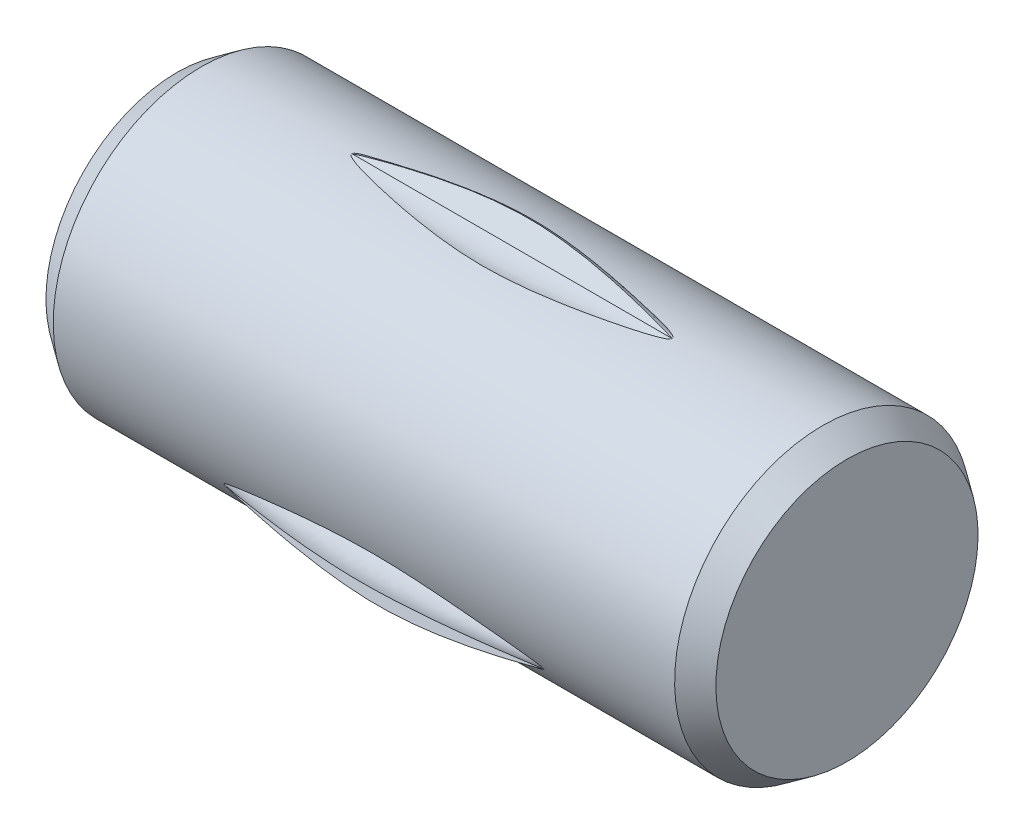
ISO-10303-21;
HEADER;
FILE_DESCRIPTION(('STEP AP214'),'2;1');
FILE_NAME('part.step','',(''),(''),'','','');
FILE_SCHEMA(('AUTOMOTIVE_DESIGN { 1 0 10303 214 1 1 1 1 }'));
ENDSEC;
DATA;
#1=APPLICATION_CONTEXT('core data for automotive mechanical design processes');
#2=APPLICATION_PROTOCOL_DEFINITION('international standard','automotive_design',2000,#1);
#3=PRODUCT_CONTEXT('',#1,'mechanical');
#4=PRODUCT('Part','Part','',(#3));
#5=PRODUCT_RELATED_PRODUCT_CATEGORY('part','',(#4));
#6=PRODUCT_DEFINITION_FORMATION('','',#4);
#7=PRODUCT_DEFINITION_CONTEXT('part definition',#1,'design');
#8=PRODUCT_DEFINITION('design','',#6,#7);
#9=PRODUCT_DEFINITION_SHAPE('','',#8);
#10=(LENGTH_UNIT() NAMED_UNIT(*) SI_UNIT(.MILLI.,.METRE.));
#11=(NAMED_UNIT(*) PLANE_ANGLE_UNIT() SI_UNIT($,.RADIAN.));
#12=(NAMED_UNIT(*) SI_UNIT($,.STERADIAN.) SOLID_ANGLE_UNIT());
#13=UNCERTAINTY_MEASURE_WITH_UNIT(LENGTH_MEASURE(1.E-05),#10,'distance_accuracy_value','');
#14=(GEOMETRIC_REPRESENTATION_CONTEXT(3) GLOBAL_UNCERTAINTY_ASSIGNED_CONTEXT((#13)) GLOBAL_UNIT_ASSIGNED_CONTEXT((#10,
#11,#12)) REPRESENTATION_CONTEXT('',''));
#15=CARTESIAN_POINT('',(0.,0.,0.));
#16=DIRECTION('',(0.,0.,1.));
#17=DIRECTION('',(1.,0.,0.));
#18=AXIS2_PLACEMENT_3D('',#15,#16,#17);
#19=CARTESIAN_POINT('',(0.8382,-0.388870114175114,0.669991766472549));
#20=CARTESIAN_POINT('',(0.558799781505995,-0.417586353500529,0.716876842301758));
#21=CARTESIAN_POINT('',(-1.52946281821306E-06,-0.475018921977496,0.810647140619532));
#22=CARTESIAN_POINT('',(-0.558800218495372,-0.418041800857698,0.716583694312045));
#23=CARTESIAN_POINT('',(-0.8382,-0.389553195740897,0.669551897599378));
#24=CARTESIAN_POINT('',(0.8382,-0.378911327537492,0.676278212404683));
#25=CARTESIAN_POINT('',(0.558799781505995,-0.395353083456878,0.730681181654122));
#26=CARTESIAN_POINT('',(-1.52946281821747E-06,-0.428236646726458,0.839487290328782));
#27=CARTESIAN_POINT('',(-0.558800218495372,-0.395885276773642,0.730507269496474));
#28=CARTESIAN_POINT('',(-0.8382,-0.379709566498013,0.676017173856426));
#29=CARTESIAN_POINT('',(0.838200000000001,-0.353634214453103,0.679154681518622));
#30=CARTESIAN_POINT('',(0.558799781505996,-0.339517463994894,0.739162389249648));
#31=CARTESIAN_POINT('',(-1.52946281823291E-06,-0.311283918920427,0.859177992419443));
#32=CARTESIAN_POINT('',(-0.558800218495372,-0.340086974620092,0.739292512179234));
#33=CARTESIAN_POINT('',(-0.8382,-0.354488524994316,0.679349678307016));
#34=CARTESIAN_POINT('',(0.838200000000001,-0.321704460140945,0.659556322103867));
#35=CARTESIAN_POINT('',(0.558799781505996,-0.270186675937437,0.690898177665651));
#36=CARTESIAN_POINT('',(-1.52946281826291E-06,-0.16715094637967,0.753581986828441));
#37=CARTESIAN_POINT('',(-0.558800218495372,-0.27052361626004,0.691414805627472));
#38=CARTESIAN_POINT('',(-0.838200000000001,-0.322210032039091,0.660331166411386));
#39=CARTESIAN_POINT('',(0.8382,-0.317825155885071,0.621221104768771));
#40=CARTESIAN_POINT('',(0.558799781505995,-0.257746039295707,0.606871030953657));
#41=CARTESIAN_POINT('',(-1.52946281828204E-06,-0.137587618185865,0.578170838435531));
#42=CARTESIAN_POINT('',(-0.558800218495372,-0.257621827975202,0.607438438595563));
#43=CARTESIAN_POINT('',(-0.8382,-0.317639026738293,0.62207226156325));
#44=CARTESIAN_POINT('',(0.8382,-0.337291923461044,0.588283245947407));
#45=CARTESIAN_POINT('',(0.558799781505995,-0.305914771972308,0.53702594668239));
#46=CARTESIAN_POINT('',(-1.5294628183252E-06,-0.243160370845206,0.434511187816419));
#47=CARTESIAN_POINT('',(-0.558800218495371,-0.305391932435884,0.537362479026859));
#48=CARTESIAN_POINT('',(-0.838199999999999,-0.33650776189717,0.588788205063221));
#49=CARTESIAN_POINT('',(0.8382,-0.375400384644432,0.584876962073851));
#50=CARTESIAN_POINT('',(0.558799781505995,-0.389891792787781,0.524829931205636));
#51=CARTESIAN_POINT('',(-1.52946281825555E-06,-0.418874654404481,0.404735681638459));
#52=CARTESIAN_POINT('',(-0.558800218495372,-0.389323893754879,0.52470799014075));
#53=CARTESIAN_POINT('',(-0.8382,-0.374548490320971,0.58469423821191));
#54=CARTESIAN_POINT('',(0.838200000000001,-0.408339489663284,0.604868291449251));
#55=CARTESIAN_POINT('',(0.558799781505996,-0.45967568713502,0.573239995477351));
#56=CARTESIAN_POINT('',(-1.52946281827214E-06,-0.562348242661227,0.509983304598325));
#57=CARTESIAN_POINT('',(-0.558800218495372,-0.459344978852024,0.572719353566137));
#58=CARTESIAN_POINT('',(-0.838200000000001,-0.407843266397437,0.604087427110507));
#59=CARTESIAN_POINT('',(0.838200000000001,-0.41229818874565,0.642123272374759));
#60=CARTESIAN_POINT('',(0.558799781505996,-0.472181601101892,0.656796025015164));
#61=CARTESIAN_POINT('',(-1.52946281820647E-06,-0.591948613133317,0.686141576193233));
#62=CARTESIAN_POINT('',(-0.558800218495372,-0.472299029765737,0.656223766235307));
#63=CARTESIAN_POINT('',(-0.8382,-0.412474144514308,0.6412648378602));
#64=CARTESIAN_POINT('',(0.8382,-0.398828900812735,0.663705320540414));
#65=CARTESIAN_POINT('',(0.558799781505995,-0.439819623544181,0.703072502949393));
#66=CARTESIAN_POINT('',(-1.52946281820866E-06,-0.521801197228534,0.781806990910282));
#67=CARTESIAN_POINT('',(-0.558800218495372,-0.440198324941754,0.702660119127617));
#68=CARTESIAN_POINT('',(-0.8382,-0.399396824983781,0.663086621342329));
#69=CARTESIAN_POINT('',(0.8382,-0.388870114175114,0.669991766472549));
#70=CARTESIAN_POINT('',(0.558799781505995,-0.417586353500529,0.716876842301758));
#71=CARTESIAN_POINT('',(-1.52946281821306E-06,-0.475018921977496,0.810647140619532));
#72=CARTESIAN_POINT('',(-0.558800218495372,-0.418041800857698,0.716583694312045));
#73=CARTESIAN_POINT('',(-0.8382,-0.389553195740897,0.669551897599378));
#74=B_SPLINE_SURFACE_WITH_KNOTS('',3,3,((#19,#20,#21,#22,#23),(#24,#25,#26,#27,#28),(#29,#30,
#31,#32,#33),(#34,#35,#36,#37,#38),(#39,#40,#41,#42,#43),(#44,#45,#46,#47,#48),(#49,#50,#51,#52,
#53),(#54,#55,#56,#57,#58),(#59,#60,#61,#62,#63),(#64,#65,#66,#67,#68),(#69,#70,#71,#72,#73)),
.UNSPECIFIED.,.T.,.F.,.F.,(4,1,1,1,1,1,1,1,4),(4,1,4),(0.,0.125,0.25,0.375,0.5,0.625,0.75,0.875,
1.),(0.,0.499999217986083,1.),.UNSPECIFIED.);
#75=CARTESIAN_POINT('',(0.838171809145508,-0.387605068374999,0.67076255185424));
#76=CARTESIAN_POINT('',(0.838170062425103,-0.386740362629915,0.671262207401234));
#77=CARTESIAN_POINT('',(0.837971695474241,-0.385873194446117,0.671760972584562));
#78=CARTESIAN_POINT('',(0.837166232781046,-0.383939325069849,0.672868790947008));
#79=CARTESIAN_POINT('',(0.83643582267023,-0.382916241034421,0.673451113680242));
#80=CARTESIAN_POINT('',(0.834563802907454,-0.380825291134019,0.674636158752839));
#81=CARTESIAN_POINT('',(0.833366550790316,-0.379799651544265,0.67521369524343));
#82=CARTESIAN_POINT('',(0.830821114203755,-0.37789300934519,0.67628258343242));
#83=CARTESIAN_POINT('',(0.829472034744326,-0.37701294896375,0.676773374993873));
#84=CARTESIAN_POINT('',(0.825378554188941,-0.374556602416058,0.678137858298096));
#85=CARTESIAN_POINT('',(0.822528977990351,-0.373115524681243,0.678931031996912));
#86=CARTESIAN_POINT('',(0.816727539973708,-0.370424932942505,0.680402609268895));
#87=CARTESIAN_POINT('',(0.813775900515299,-0.369175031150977,0.681081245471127));
#88=CARTESIAN_POINT('',(0.804810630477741,-0.365593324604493,0.683014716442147));
#89=CARTESIAN_POINT('',(0.798703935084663,-0.363438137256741,0.684162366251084));
#90=CARTESIAN_POINT('',(0.780374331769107,-0.357363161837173,0.687366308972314));
#91=CARTESIAN_POINT('',(0.768010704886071,-0.353778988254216,0.689213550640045));
#92=CARTESIAN_POINT('',(0.743130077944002,-0.347024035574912,0.692638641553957));
#93=CARTESIAN_POINT('',(0.730612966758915,-0.343853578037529,0.694216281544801));
#94=CARTESIAN_POINT('',(0.705512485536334,-0.337774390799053,0.697194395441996));
#95=CARTESIAN_POINT('',(0.692929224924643,-0.334865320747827,0.698595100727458));
#96=CARTESIAN_POINT('',(0.667715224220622,-0.329227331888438,0.701269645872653));
#97=CARTESIAN_POINT('',(0.655084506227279,-0.326498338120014,0.702543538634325));
#98=CARTESIAN_POINT('',(0.617049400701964,-0.31850215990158,0.706223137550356));
#99=CARTESIAN_POINT('',(0.591585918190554,-0.313445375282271,0.708477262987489));
#100=CARTESIAN_POINT('',(0.540547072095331,-0.303785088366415,0.712672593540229));
#101=CARTESIAN_POINT('',(0.514971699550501,-0.299181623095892,0.714613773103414));
#102=CARTESIAN_POINT('',(0.438067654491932,-0.286050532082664,0.720017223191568));
#103=CARTESIAN_POINT('',(0.386588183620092,-0.278207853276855,0.7230568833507));
#104=CARTESIAN_POINT('',(0.283345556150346,-0.26485632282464,0.728053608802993));
#105=CARTESIAN_POINT('',(0.231582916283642,-0.259344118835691,0.730012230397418));
#106=CARTESIAN_POINT('',(0.127815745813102,-0.251336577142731,0.732808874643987));
#107=CARTESIAN_POINT('',(0.0758114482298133,-0.248838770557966,0.733647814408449));
#108=CARTESIAN_POINT('',(-0.0281245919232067,-0.247719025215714,0.73402746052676));
#109=CARTESIAN_POINT('',(-0.0800562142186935,-0.249087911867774,0.733571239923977));
#110=CARTESIAN_POINT('',(-0.183708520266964,-0.255110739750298,0.731496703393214));
#111=CARTESIAN_POINT('',(-0.235429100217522,-0.259766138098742,0.729877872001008));
#112=CARTESIAN_POINT('',(-0.338422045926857,-0.271571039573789,0.725567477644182));
#113=CARTESIAN_POINT('',(-0.389695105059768,-0.278715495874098,0.722878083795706));
#114=CARTESIAN_POINT('',(-0.49187660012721,-0.29490168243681,0.716428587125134));
#115=CARTESIAN_POINT('',(-0.542784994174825,-0.303943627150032,0.712668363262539));
#116=CARTESIAN_POINT('',(-0.618787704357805,-0.318860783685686,0.706057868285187));
#117=CARTESIAN_POINT('',(-0.644057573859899,-0.324057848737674,0.703693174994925));
#118=CARTESIAN_POINT('',(-0.68181241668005,-0.332339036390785,0.699799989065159));
#119=CARTESIAN_POINT('',(-0.694368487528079,-0.335179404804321,0.69844504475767));
#120=CARTESIAN_POINT('',(-0.719405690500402,-0.3410833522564,0.695581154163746));
#121=CARTESIAN_POINT('',(-0.731886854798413,-0.344146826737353,0.69407227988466));
#122=CARTESIAN_POINT('',(-0.750515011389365,-0.349013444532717,0.691630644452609));
#123=CARTESIAN_POINT('',(-0.756709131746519,-0.350680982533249,0.690786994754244));
#124=CARTESIAN_POINT('',(-0.769058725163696,-0.354142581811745,0.689018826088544));
#125=CARTESIAN_POINT('',(-0.775214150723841,-0.355936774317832,0.688094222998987));
#126=CARTESIAN_POINT('',(-0.787483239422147,-0.359717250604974,0.68612543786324));
#127=CARTESIAN_POINT('',(-0.79359647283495,-0.361704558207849,0.685080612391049));
#128=CARTESIAN_POINT('',(-0.805688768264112,-0.365964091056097,0.682815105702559));
#129=CARTESIAN_POINT('',(-0.811668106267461,-0.368235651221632,0.68159483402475));
#130=CARTESIAN_POINT('',(-0.820380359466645,-0.372136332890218,0.679467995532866));
#131=CARTESIAN_POINT('',(-0.823257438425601,-0.373528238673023,0.678704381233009));
#132=CARTESIAN_POINT('',(-0.828789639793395,-0.376595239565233,0.677007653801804));
#133=CARTESIAN_POINT('',(-0.831447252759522,-0.378266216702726,0.67607699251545));
#134=CARTESIAN_POINT('',(-0.834719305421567,-0.381128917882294,0.674464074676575));
#135=CARTESIAN_POINT('',(-0.83563463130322,-0.382050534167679,0.673942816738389));
#136=CARTESIAN_POINT('',(-0.837158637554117,-0.384114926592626,0.672768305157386));
#137=CARTESIAN_POINT('',(-0.837763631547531,-0.385260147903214,0.672113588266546));
#138=CARTESIAN_POINT('',(-0.838172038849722,-0.387250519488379,0.670967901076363));
#139=CARTESIAN_POINT('',(-0.838182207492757,-0.388059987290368,0.670500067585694));
#140=CARTESIAN_POINT('',(-0.837884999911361,-0.389625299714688,0.669591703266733));
#141=CARTESIAN_POINT('',(-0.837578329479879,-0.390381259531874,0.669151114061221));
#142=CARTESIAN_POINT('',(-0.836478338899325,-0.392309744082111,0.668023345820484));
#143=CARTESIAN_POINT('',(-0.835493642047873,-0.393390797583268,0.667386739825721));
#144=CARTESIAN_POINT('',(-0.832823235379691,-0.395809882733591,0.665956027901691));
#145=CARTESIAN_POINT('',(-0.831023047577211,-0.397038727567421,0.665223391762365));
#146=CARTESIAN_POINT('',(-0.827256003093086,-0.399301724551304,0.663867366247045));
#147=CARTESIAN_POINT('',(-0.825288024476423,-0.400334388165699,0.663244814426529));
#148=CARTESIAN_POINT('',(-0.818785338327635,-0.403488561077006,0.66133482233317));
#149=CARTESIAN_POINT('',(-0.814098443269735,-0.405369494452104,0.660181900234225));
#150=CARTESIAN_POINT('',(-0.804596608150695,-0.408875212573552,0.658016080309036));
#151=CARTESIAN_POINT('',(-0.799781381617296,-0.410499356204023,0.657003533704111));
#152=CARTESIAN_POINT('',(-0.790083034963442,-0.413583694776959,0.655066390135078));
#153=CARTESIAN_POINT('',(-0.785199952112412,-0.415043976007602,0.654141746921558));
#154=CARTESIAN_POINT('',(-0.775398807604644,-0.417851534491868,0.652351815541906));
#155=CARTESIAN_POINT('',(-0.77048080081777,-0.419198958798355,0.651486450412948));
#156=CARTESIAN_POINT('',(-0.745980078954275,-0.425699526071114,0.647285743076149));
#157=CARTESIAN_POINT('',(-0.726196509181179,-0.430278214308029,0.644242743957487));
#158=CARTESIAN_POINT('',(-0.686456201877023,-0.438867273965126,0.638421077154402));
#159=CARTESIAN_POINT('',(-0.666499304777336,-0.442877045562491,0.635642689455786));
#160=CARTESIAN_POINT('',(-0.626500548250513,-0.450494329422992,0.630267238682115));
#161=CARTESIAN_POINT('',(-0.606458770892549,-0.454102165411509,0.627670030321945));
#162=CARTESIAN_POINT('',(-0.566310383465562,-0.460993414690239,0.622626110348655));
#163=CARTESIAN_POINT('',(-0.546203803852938,-0.464276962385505,0.620179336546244));
#164=CARTESIAN_POINT('',(-0.487666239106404,-0.473389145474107,0.613285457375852));
#165=CARTESIAN_POINT('',(-0.449149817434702,-0.4788260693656,0.609036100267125));
#166=CARTESIAN_POINT('',(-0.371895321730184,-0.488597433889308,0.601225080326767));
#167=CARTESIAN_POINT('',(-0.333157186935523,-0.492931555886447,0.597663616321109));
#168=CARTESIAN_POINT('',(-0.255529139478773,-0.50035429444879,0.591463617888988));
#169=CARTESIAN_POINT('',(-0.216639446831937,-0.503444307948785,0.588824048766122));
#170=CARTESIAN_POINT('',(-0.138718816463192,-0.508221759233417,0.584705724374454));
#171=CARTESIAN_POINT('',(-0.0996879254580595,-0.509909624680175,0.583226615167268));
#172=CARTESIAN_POINT('',(-0.0231677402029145,-0.511595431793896,0.581748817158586));
#173=CARTESIAN_POINT('',(0.0143187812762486,-0.511660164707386,0.581691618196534));
#174=CARTESIAN_POINT('',(0.0892434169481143,-0.510248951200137,0.582929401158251));
#175=CARTESIAN_POINT('',(0.126681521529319,-0.508772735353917,0.584224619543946));
#176=CARTESIAN_POINT('',(0.201450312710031,-0.50451031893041,0.587909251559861));
#177=CARTESIAN_POINT('',(0.238780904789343,-0.501723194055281,0.590299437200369));
#178=CARTESIAN_POINT('',(0.31326556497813,-0.49498653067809,0.595959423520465));
#179=CARTESIAN_POINT('',(0.350419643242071,-0.491037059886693,0.599229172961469));
#180=CARTESIAN_POINT('',(0.413064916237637,-0.483484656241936,0.605325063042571));
#181=CARTESIAN_POINT('',(0.438606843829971,-0.480152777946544,0.607975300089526));
#182=CARTESIAN_POINT('',(0.489583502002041,-0.473016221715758,0.613543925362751));
#183=CARTESIAN_POINT('',(0.515018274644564,-0.469211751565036,0.616462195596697));
#184=CARTESIAN_POINT('',(0.574619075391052,-0.459723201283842,0.623587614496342));
#185=CARTESIAN_POINT('',(0.608743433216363,-0.453845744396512,0.627889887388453));
#186=CARTESIAN_POINT('',(0.665506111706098,-0.44311661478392,0.635480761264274));
#187=CARTESIAN_POINT('',(0.688218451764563,-0.438566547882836,0.638635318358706));
#188=CARTESIAN_POINT('',(0.72593133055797,-0.430304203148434,0.644216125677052));
#189=CARTESIAN_POINT('',(0.740994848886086,-0.426813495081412,0.646537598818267));
#190=CARTESIAN_POINT('',(0.765969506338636,-0.420463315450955,0.650676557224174));
#191=CARTESIAN_POINT('',(0.77593720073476,-0.417776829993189,0.652406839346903));
#192=CARTESIAN_POINT('',(0.792423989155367,-0.412869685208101,0.655518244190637));
#193=CARTESIAN_POINT('',(0.798997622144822,-0.410787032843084,0.656826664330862));
#194=CARTESIAN_POINT('',(0.809847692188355,-0.406950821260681,0.659207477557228));
#195=CARTESIAN_POINT('',(0.814174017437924,-0.405311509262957,0.660217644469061));
#196=CARTESIAN_POINT('',(0.82125657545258,-0.402249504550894,0.662085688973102));
#197=CARTESIAN_POINT('',(0.824072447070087,-0.400925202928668,0.662888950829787));
#198=CARTESIAN_POINT('',(0.829574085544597,-0.397942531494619,0.664684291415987));
#199=CARTESIAN_POINT('',(0.832256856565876,-0.396278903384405,0.665679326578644));
#200=CARTESIAN_POINT('',(0.835394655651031,-0.393393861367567,0.667384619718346));
#201=CARTESIAN_POINT('',(0.836221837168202,-0.392503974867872,0.667908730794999));
#202=CARTESIAN_POINT('',(0.837398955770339,-0.390715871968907,0.668955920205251));
#203=CARTESIAN_POINT('',(0.837810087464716,-0.389852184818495,0.669459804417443));
#204=CARTESIAN_POINT('',(0.838119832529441,-0.388509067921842,0.670239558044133));
#205=CARTESIAN_POINT('',(0.838172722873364,-0.388057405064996,0.670501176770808));
#206=CARTESIAN_POINT('',(0.838171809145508,-0.387605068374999,0.67076255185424));
#207=B_SPLINE_CURVE_WITH_KNOTS('',3,(#75,#76,#77,#78,#79,#80,#81,#82,#83,#84,#85,#86,#87,#88,
#89,#90,#91,#92,#93,#94,#95,#96,#97,#98,#99,#100,#101,#102,#103,#104,#105,#106,#107,#108,#109,
#110,#111,#112,#113,#114,#115,#116,#117,#118,#119,#120,#121,#122,#123,#124,#125,#126,#127,#128,
#129,#130,#131,#132,#133,#134,#135,#136,#137,#138,#139,#140,#141,#142,#143,#144,#145,#146,#147,
#148,#149,#150,#151,#152,#153,#154,#155,#156,#157,#158,#159,#160,#161,#162,#163,#164,#165,#166,
#167,#168,#169,#170,#171,#172,#173,#174,#175,#176,#177,#178,#179,#180,#181,#182,#183,#184,#185,
#186,#187,#188,#189,#190,#191,#192,#193,#194,#195,#196,#197,#198,#199,#200,#201,#202,#203,#204,
#205,#206),.UNSPECIFIED.,.T.,.F.,(4,2,2,2,2,2,2,2,2,2,2,2,2,2,2,2,2,2,2,2,2,2,2,2,2,2,2,2,2,2,2,
2,2,2,2,2,2,2,2,2,2,2,2,2,2,2,2,2,2,2,2,2,2,2,2,2,2,2,2,2,2,2,2,2,2,4),(0.,0.00298982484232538,
0.00707724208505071,0.0120893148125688,0.0171326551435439,0.02697938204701,0.0368058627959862,
0.0565182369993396,0.0955092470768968,0.134530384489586,0.173499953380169,0.212453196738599,
0.290619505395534,0.368792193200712,0.525220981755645,0.681423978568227,0.837498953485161,
0.993203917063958,1.14897795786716,1.30443797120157,1.45991556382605,1.53762718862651,
1.57645884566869,1.61527242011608,1.63468131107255,1.6541106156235,1.67364921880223,
1.69314293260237,1.70300385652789,1.71273039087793,1.71691019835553,1.72113856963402,
1.72388349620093,1.72662232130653,1.73133109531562,1.73819723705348,1.74511355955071,
1.76061982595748,1.77616421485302,1.79170037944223,1.80721597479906,1.86878309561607,
1.93041465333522,1.99199620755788,2.05355213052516,2.17091939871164,2.28832053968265,
2.40558948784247,2.5228226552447,2.63522343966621,2.74764387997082,2.86014370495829,
2.97263697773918,3.05031426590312,3.12795752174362,3.23261971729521,3.30274120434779,
3.34964061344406,3.38103084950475,3.40208223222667,3.41626686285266,3.42591507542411,
3.43572603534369,3.43966338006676,3.44284334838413,3.44440735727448),.UNSPECIFIED.);
#208=CARTESIAN_POINT('',(-0.838129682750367,-0.387350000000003,0.670909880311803));
#209=VERTEX_POINT('',#208);
#210=CARTESIAN_POINT('',(0.838166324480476,-0.387350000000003,0.670909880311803));
#211=VERTEX_POINT('',#210);
#212=EDGE_CURVE('E206',#209,#211,#207,.T.);
#213=CARTESIAN_POINT('',(0.838166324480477,-0.387350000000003,0.670909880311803));
#214=CARTESIAN_POINT('',(0.825837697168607,-0.390642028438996,0.671791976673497));
#215=CARTESIAN_POINT('',(0.813454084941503,-0.393726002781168,0.672618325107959));
#216=CARTESIAN_POINT('',(0.788619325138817,-0.39962151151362,0.674198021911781));
#217=CARTESIAN_POINT('',(0.776168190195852,-0.402433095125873,0.674951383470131));
#218=CARTESIAN_POINT('',(0.738773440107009,-0.410675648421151,0.677159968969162));
#219=CARTESIAN_POINT('',(0.713785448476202,-0.415915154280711,0.678563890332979));
#220=CARTESIAN_POINT('',(0.663736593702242,-0.426060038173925,0.681282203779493));
#221=CARTESIAN_POINT('',(0.638675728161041,-0.430965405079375,0.682596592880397));
#222=CARTESIAN_POINT('',(0.563366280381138,-0.445205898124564,0.686412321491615));
#223=CARTESIAN_POINT('',(0.513018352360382,-0.454059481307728,0.688784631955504));
#224=CARTESIAN_POINT('',(0.411991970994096,-0.470090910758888,0.693080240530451));
#225=CARTESIAN_POINT('',(0.361313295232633,-0.47726747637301,0.695003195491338));
#226=CARTESIAN_POINT('',(0.259702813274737,-0.489322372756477,0.698233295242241));
#227=CARTESIAN_POINT('',(0.20877128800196,-0.494202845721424,0.69954101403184));
#228=CARTESIAN_POINT('',(0.106604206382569,-0.501017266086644,0.701366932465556));
#229=CARTESIAN_POINT('',(0.0553683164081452,-0.502946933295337,0.701883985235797));
#230=CARTESIAN_POINT('',(-0.0471816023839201,-0.503132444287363,0.701933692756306));
#231=CARTESIAN_POINT('',(-0.0984956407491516,-0.501383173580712,0.701464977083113));
#232=CARTESIAN_POINT('',(-0.207890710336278,-0.49442659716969,0.699600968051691));
#233=CARTESIAN_POINT('',(-0.265939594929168,-0.488779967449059,0.698087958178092));
#234=CARTESIAN_POINT('',(-0.352731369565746,-0.478137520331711,0.695236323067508));
#235=CARTESIAN_POINT('',(-0.381626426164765,-0.474225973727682,0.694188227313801));
#236=CARTESIAN_POINT('',(-0.43932197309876,-0.465788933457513,0.691927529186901));
#237=CARTESIAN_POINT('',(-0.468122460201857,-0.461263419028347,0.690714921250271));
#238=CARTESIAN_POINT('',(-0.525544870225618,-0.451713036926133,0.688155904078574));
#239=CARTESIAN_POINT('',(-0.554167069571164,-0.446689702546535,0.686809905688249));
#240=CARTESIAN_POINT('',(-0.611324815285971,-0.436210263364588,0.684001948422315));
#241=CARTESIAN_POINT('',(-0.639860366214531,-0.430754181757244,0.68253999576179));
#242=CARTESIAN_POINT('',(-0.682572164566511,-0.422260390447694,0.680264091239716));
#243=CARTESIAN_POINT('',(-0.696782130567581,-0.419380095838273,0.679492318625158));
#244=CARTESIAN_POINT('',(-0.725174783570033,-0.413499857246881,0.677916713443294));
#245=CARTESIAN_POINT('',(-0.739357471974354,-0.410499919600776,0.677112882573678));
#246=CARTESIAN_POINT('',(-0.767687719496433,-0.40434061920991,0.675462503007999));
#247=CARTESIAN_POINT('',(-0.781835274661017,-0.401181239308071,0.67461594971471));
#248=CARTESIAN_POINT('',(-0.803004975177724,-0.396229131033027,0.673289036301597));
#249=CARTESIAN_POINT('',(-0.810053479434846,-0.394542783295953,0.672837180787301));
#250=CARTESIAN_POINT('',(-0.824119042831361,-0.391049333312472,0.671901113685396));
#251=CARTESIAN_POINT('',(-0.831136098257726,-0.38924221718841,0.671416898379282));
#252=CARTESIAN_POINT('',(-0.838129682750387,-0.387350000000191,0.670909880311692));
#253=B_SPLINE_CURVE_WITH_KNOTS('',3,(#213,#214,#215,#216,#217,#218,#219,#220,#221,#222,#223,
#224,#225,#226,#227,#228,#229,#230,#231,#232,#233,#234,#235,#236,#237,#238,#239,#240,#241,#242,
#243,#244,#245,#246,#247,#248,#249,#250,#251,#252),.UNSPECIFIED.,.F.,.F.,(4,2,2,2,2,2,2,2,2,2,2,
2,2,2,2,2,2,2,2,4),(0.,0.0383649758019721,0.0767230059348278,0.153429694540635,0.23013893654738,
0.38364194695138,0.537261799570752,0.690738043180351,0.844436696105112,0.998349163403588,
1.17326526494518,1.26079268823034,1.34832307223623,1.43559177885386,1.52285581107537,
1.56641380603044,1.60996949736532,1.65352988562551,1.67531344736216,1.69709951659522),.UNSPECIFIED.);
#254=EDGE_CURVE('E12',#211,#209,#253,.T.);
#255=CARTESIAN_POINT('',(0.8382,-0.321716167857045,0.622120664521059));
#256=CARTESIAN_POINT('',(0.558799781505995,-0.267847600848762,0.609234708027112));
#257=CARTESIAN_POINT('',(-1.52946281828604E-06,-0.160110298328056,0.583462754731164));
#258=CARTESIAN_POINT('',(-0.558800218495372,-0.267733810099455,0.609755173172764));
#259=CARTESIAN_POINT('',(-0.8382,-0.321545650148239,0.622901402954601));
#260=CARTESIAN_POINT('',(0.8382,-0.324314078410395,0.610241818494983));
#261=CARTESIAN_POINT('',(0.558799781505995,-0.273802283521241,0.583589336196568));
#262=CARTESIAN_POINT('',(-1.52946281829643E-06,-0.172778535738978,0.53028428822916));
#263=CARTESIAN_POINT('',(-0.558800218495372,-0.273545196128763,0.584079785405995));
#264=CARTESIAN_POINT('',(-0.8382,-0.323928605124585,0.61097757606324));
#265=CARTESIAN_POINT('',(0.8382,-0.337291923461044,0.588283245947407));
#266=CARTESIAN_POINT('',(0.558799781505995,-0.305914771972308,0.53702594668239));
#267=CARTESIAN_POINT('',(-1.5294628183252E-06,-0.243160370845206,0.434511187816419));
#268=CARTESIAN_POINT('',(-0.558800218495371,-0.305391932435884,0.537362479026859));
#269=CARTESIAN_POINT('',(-0.838199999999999,-0.33650776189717,0.588788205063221));
#270=CARTESIAN_POINT('',(0.8382,-0.375400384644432,0.584876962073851));
#271=CARTESIAN_POINT('',(0.558799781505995,-0.389891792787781,0.524829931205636));
#272=CARTESIAN_POINT('',(-1.52946281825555E-06,-0.418874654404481,0.404735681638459));
#273=CARTESIAN_POINT('',(-0.558800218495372,-0.389323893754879,0.52470799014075));
#274=CARTESIAN_POINT('',(-0.8382,-0.374548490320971,0.58469423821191));
#275=CARTESIAN_POINT('',(0.838200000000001,-0.408339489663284,0.604868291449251));
#276=CARTESIAN_POINT('',(0.558799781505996,-0.45967568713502,0.573239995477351));
#277=CARTESIAN_POINT('',(-1.52946281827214E-06,-0.562348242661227,0.509983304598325));
#278=CARTESIAN_POINT('',(-0.558800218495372,-0.459344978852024,0.572719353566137));
#279=CARTESIAN_POINT('',(-0.838200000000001,-0.407843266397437,0.604087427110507));
#280=CARTESIAN_POINT('',(0.838200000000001,-0.41229818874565,0.642123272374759));
#281=CARTESIAN_POINT('',(0.558799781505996,-0.472181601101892,0.656796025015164));
#282=CARTESIAN_POINT('',(-1.52946281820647E-06,-0.591948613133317,0.686141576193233));
#283=CARTESIAN_POINT('',(-0.558800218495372,-0.472299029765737,0.656223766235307));
#284=CARTESIAN_POINT('',(-0.8382,-0.412474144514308,0.6412648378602));
#285=CARTESIAN_POINT('',(0.8382,-0.398828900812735,0.663705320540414));
#286=CARTESIAN_POINT('',(0.558799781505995,-0.439819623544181,0.703072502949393));
#287=CARTESIAN_POINT('',(-1.52946281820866E-06,-0.521801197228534,0.781806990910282));
#288=CARTESIAN_POINT('',(-0.558800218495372,-0.440198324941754,0.702660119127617));
#289=CARTESIAN_POINT('',(-0.8382,-0.399396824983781,0.663086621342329));
#290=CARTESIAN_POINT('',(0.8382,-0.378911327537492,0.676278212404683));
#291=CARTESIAN_POINT('',(0.558799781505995,-0.395353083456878,0.730681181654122));
#292=CARTESIAN_POINT('',(-1.52946281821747E-06,-0.428236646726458,0.839487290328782));
#293=CARTESIAN_POINT('',(-0.558800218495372,-0.395885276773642,0.730507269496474));
#294=CARTESIAN_POINT('',(-0.8382,-0.379709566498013,0.676017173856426));
#295=CARTESIAN_POINT('',(0.838200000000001,-0.353634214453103,0.679154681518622));
#296=CARTESIAN_POINT('',(0.558799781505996,-0.339517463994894,0.739162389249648));
#297=CARTESIAN_POINT('',(-1.52946281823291E-06,-0.311283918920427,0.859177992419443));
#298=CARTESIAN_POINT('',(-0.558800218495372,-0.340086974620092,0.739292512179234));
#299=CARTESIAN_POINT('',(-0.8382,-0.354488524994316,0.679349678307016));
#300=CARTESIAN_POINT('',(0.838200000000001,-0.321704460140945,0.659556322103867));
#301=CARTESIAN_POINT('',(0.558799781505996,-0.270186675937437,0.690898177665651));
#302=CARTESIAN_POINT('',(-1.52946281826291E-06,-0.16715094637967,0.753581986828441));
#303=CARTESIAN_POINT('',(-0.558800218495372,-0.27052361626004,0.691414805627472));
#304=CARTESIAN_POINT('',(-0.838200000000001,-0.322210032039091,0.660331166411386));
#305=CARTESIAN_POINT('',(0.838200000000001,-0.319118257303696,0.633999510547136));
#306=CARTESIAN_POINT('',(0.558799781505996,-0.261892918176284,0.634880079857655));
#307=CARTESIAN_POINT('',(-1.52946281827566E-06,-0.147442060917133,0.636641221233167));
#308=CARTESIAN_POINT('',(-0.558800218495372,-0.261922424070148,0.635430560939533));
#309=CARTESIAN_POINT('',(-0.8382,-0.319162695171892,0.634825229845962));
#310=CARTESIAN_POINT('',(0.8382,-0.321716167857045,0.622120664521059));
#311=CARTESIAN_POINT('',(0.558799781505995,-0.267847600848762,0.609234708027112));
#312=CARTESIAN_POINT('',(-1.52946281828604E-06,-0.160110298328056,0.583462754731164));
#313=CARTESIAN_POINT('',(-0.558800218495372,-0.267733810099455,0.609755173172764));
#314=CARTESIAN_POINT('',(-0.8382,-0.321545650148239,0.622901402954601));
#315=B_SPLINE_SURFACE_WITH_KNOTS('',3,3,((#255,#256,#257,#258,#259),(#260,#261,#262,#263,#264),
(#265,#266,#267,#268,#269),(#270,#271,#272,#273,#274),(#275,#276,#277,#278,#279),(#280,#281,
#282,#283,#284),(#285,#286,#287,#288,#289),(#290,#291,#292,#293,#294),(#295,#296,#297,#298,
#299),(#300,#301,#302,#303,#304),(#305,#306,#307,#308,#309),(#310,#311,#312,#313,#314)),
.UNSPECIFIED.,.T.,.F.,.F.,(4,1,1,1,1,2,1,1,4),(4,1,4),(0.375,0.5,0.625,0.75,0.875,1.,1.125,1.25,
1.375),(0.,0.499999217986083,1.),.UNSPECIFIED.);
#316=ORIENTED_EDGE('',*,*,#212,.T.);
#317=ORIENTED_EDGE('',*,*,#254,.T.);
#318=EDGE_LOOP('',(#316,#317));
#319=FACE_BOUND('',#318,.T.);
#320=ADVANCED_FACE('F75',(#319),#315,.T.);
#321=EDGE_CURVE('E135',#211,#209,#207,.T.);
#322=CARTESIAN_POINT('',(-0.838129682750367,-0.387350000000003,0.670909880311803));
#323=CARTESIAN_POINT('',(-0.825789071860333,-0.386481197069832,0.674152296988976));
#324=CARTESIAN_POINT('',(-0.813399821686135,-0.385662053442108,0.677209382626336));
#325=CARTESIAN_POINT('',(-0.788560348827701,-0.384090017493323,0.683076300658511));
#326=CARTESIAN_POINT('',(-0.776110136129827,-0.38333711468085,0.68588617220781));
#327=CARTESIAN_POINT('',(-0.738717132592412,-0.381127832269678,0.694131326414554));
#328=CARTESIAN_POINT('',(-0.713731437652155,-0.379720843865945,0.699382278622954));
#329=CARTESIAN_POINT('',(-0.663687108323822,-0.376996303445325,0.709550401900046));
#330=CARTESIAN_POINT('',(-0.638628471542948,-0.375678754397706,0.714467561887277));
#331=CARTESIAN_POINT('',(-0.563326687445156,-0.371854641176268,0.728739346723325));
#332=CARTESIAN_POINT('',(-0.512983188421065,-0.369478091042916,0.737608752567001));
#333=CARTESIAN_POINT('',(-0.411962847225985,-0.365175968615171,0.753664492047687));
#334=CARTESIAN_POINT('',(-0.361285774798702,-0.363250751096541,0.760849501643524));
#335=CARTESIAN_POINT('',(-0.259676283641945,-0.360017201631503,0.772917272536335));
#336=CARTESIAN_POINT('',(-0.208744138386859,-0.358708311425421,0.777802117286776));
#337=CARTESIAN_POINT('',(-0.10657569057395,-0.356880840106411,0.784622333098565));
#338=CARTESIAN_POINT('',(-0.0553390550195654,-0.35636340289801,0.786553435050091));
#339=CARTESIAN_POINT('',(0.0472113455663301,-0.356313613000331,0.786739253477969));
#340=CARTESIAN_POINT('',(0.0985251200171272,-0.356782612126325,0.784988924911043));
#341=CARTESIAN_POINT('',(0.20791901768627,-0.358647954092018,0.778027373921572));
#342=CARTESIAN_POINT('',(0.265966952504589,-0.360162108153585,0.772376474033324));
#343=CARTESIAN_POINT('',(0.352756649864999,-0.363016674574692,0.761723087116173));
#344=CARTESIAN_POINT('',(0.381651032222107,-0.364065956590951,0.757807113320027));
#345=CARTESIAN_POINT('',(0.439344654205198,-0.366329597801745,0.749359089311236));
#346=CARTESIAN_POINT('',(0.468143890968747,-0.367543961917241,0.744827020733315));
#347=CARTESIAN_POINT('',(0.525564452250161,-0.370107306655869,0.735260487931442));
#348=CARTESIAN_POINT('',(0.554186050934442,-0.371455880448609,0.730227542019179));
#349=CARTESIAN_POINT('',(0.611341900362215,-0.37426997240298,0.719725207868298));
#350=CARTESIAN_POINT('',(0.639876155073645,-0.375735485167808,0.714255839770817));
#351=CARTESIAN_POINT('',(0.682585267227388,-0.378016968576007,0.705741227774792));
#352=CARTESIAN_POINT('',(0.69679404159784,-0.378790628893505,0.702853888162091));
#353=CARTESIAN_POINT('',(0.725184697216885,-0.38036962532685,0.696960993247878));
#354=CARTESIAN_POINT('',(0.73936657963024,-0.381174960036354,0.693955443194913));
#355=CARTESIAN_POINT('',(0.767696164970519,-0.382826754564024,0.687790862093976));
#356=CARTESIAN_POINT('',(0.781843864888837,-0.383673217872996,0.684631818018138));
#357=CARTESIAN_POINT('',(0.803017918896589,-0.384995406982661,0.679697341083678));
#358=CARTESIAN_POINT('',(0.810068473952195,-0.385444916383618,0.678019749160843));
#359=CARTESIAN_POINT('',(0.824141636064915,-0.386372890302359,0.674556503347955));
#360=CARTESIAN_POINT('',(0.831164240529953,-0.386851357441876,0.672770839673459));
#361=CARTESIAN_POINT('',(0.838166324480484,-0.387349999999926,0.670909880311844));
#362=B_SPLINE_CURVE_WITH_KNOTS('',3,(#322,#323,#324,#325,#326,#327,#328,#329,#330,#331,#332,
#333,#334,#335,#336,#337,#338,#339,#340,#341,#342,#343,#344,#345,#346,#347,#348,#349,#350,#351,
#352,#353,#354,#355,#356,#357,#358,#359,#360,#361),.UNSPECIFIED.,.F.,.F.,(4,2,2,2,2,2,2,2,2,2,2,
2,2,2,2,2,2,2,2,4),(0.,0.0383606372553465,0.0767151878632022,0.15342262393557,0.230132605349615,
0.383631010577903,0.537249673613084,0.690728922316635,0.844429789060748,0.998341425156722,
1.17325570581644,1.26078299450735,1.34831289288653,1.43558510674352,1.52285329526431,
1.56641229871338,1.60996937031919,1.65353014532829,1.67531334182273,1.69709851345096),.UNSPECIFIED.);
#363=EDGE_CURVE('E89',#209,#211,#362,.T.);
#364=ORIENTED_EDGE('',*,*,#321,.T.);
#365=ORIENTED_EDGE('',*,*,#363,.T.);
#366=EDGE_LOOP('',(#364,#365));
#367=FACE_BOUND('',#366,.T.);
#368=ADVANCED_FACE('F161',(#367),#74,.T.);
#369=CARTESIAN_POINT('',(0.8382,-0.385794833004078,-0.671767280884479));
#370=CARTESIAN_POINT('',(0.558799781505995,-0.412040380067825,-0.720078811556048));
#371=CARTESIAN_POINT('',(-1.52946281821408E-06,-0.464531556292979,-0.816702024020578));
#372=CARTESIAN_POINT('',(-0.558800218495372,-0.411558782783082,-0.720326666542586));
#373=CARTESIAN_POINT('',(-0.8382,-0.385072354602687,-0.672138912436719));
#374=CARTESIAN_POINT('',(0.8382,-0.396218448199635,-0.666285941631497));
#375=CARTESIAN_POINT('',(0.558799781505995,-0.435111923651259,-0.707726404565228));
#376=CARTESIAN_POINT('',(-1.52946281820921E-06,-0.512898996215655,-0.790607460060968));
#377=CARTESIAN_POINT('',(-0.558800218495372,-0.434695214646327,-0.708100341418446));
#378=CARTESIAN_POINT('',(-0.8382,-0.395593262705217,-0.666846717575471));
#379=CARTESIAN_POINT('',(0.838200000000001,-0.411348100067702,-0.645833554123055));
#380=CARTESIAN_POINT('',(0.558799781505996,-0.470374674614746,-0.663611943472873));
#381=CARTESIAN_POINT('',(-1.52946281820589E-06,-0.588428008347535,-0.699168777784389));
#382=CARTESIAN_POINT('',(-0.558800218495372,-0.470202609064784,-0.664170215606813));
#383=CARTESIAN_POINT('',(-0.8382,-0.411089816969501,-0.646670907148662));
#384=CARTESIAN_POINT('',(0.838200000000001,-0.410340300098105,-0.608382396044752));
#385=CARTESIAN_POINT('',(0.558799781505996,-0.463242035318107,-0.579437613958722));
#386=CARTESIAN_POINT('',(-1.52946281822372E-06,-0.569045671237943,-0.521547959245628));
#387=CARTESIAN_POINT('',(-0.558800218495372,-0.463520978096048,-0.579987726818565));
#388=CARTESIAN_POINT('',(-0.838200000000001,-0.410758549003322,-0.609207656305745));
#389=CARTESIAN_POINT('',(0.8382,-0.379080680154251,-0.585855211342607));
#390=CARTESIAN_POINT('',(0.558799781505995,-0.396692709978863,-0.526650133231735));
#391=CARTESIAN_POINT('',(-1.52946281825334E-06,-0.431916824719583,-0.40823979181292));
#392=CARTESIAN_POINT('',(-0.558800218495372,-0.397246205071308,-0.526826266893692));
#393=CARTESIAN_POINT('',(-0.8382,-0.379910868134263,-0.586119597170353));
#394=CARTESIAN_POINT('',(0.8382,-0.340822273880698,-0.586244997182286));
#395=CARTESIAN_POINT('',(0.558799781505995,-0.31212072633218,-0.533442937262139));
#396=CARTESIAN_POINT('',(-1.52946281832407E-06,-0.254717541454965,-0.427838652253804));
#397=CARTESIAN_POINT('',(-0.558800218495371,-0.312673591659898,-0.533158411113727));
#398=CARTESIAN_POINT('',(-0.838199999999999,-0.341651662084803,-0.585818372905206));
#399=CARTESIAN_POINT('',(0.8382,-0.318818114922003,-0.617544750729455));
#400=CARTESIAN_POINT('',(0.558799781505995,-0.259570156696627,-0.600071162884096));
#401=CARTESIAN_POINT('',(-1.52946281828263E-06,-0.141074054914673,-0.565123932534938));
#402=CARTESIAN_POINT('',(-0.558800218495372,-0.259748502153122,-0.599518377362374));
#403=CARTESIAN_POINT('',(-0.8382,-0.319085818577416,-0.616715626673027));
#404=CARTESIAN_POINT('',(0.838200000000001,-0.319661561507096,-0.656066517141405));
#405=CARTESIAN_POINT('',(0.558799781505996,-0.266602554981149,-0.684710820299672));
#406=CARTESIAN_POINT('',(-1.52946281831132E-06,-0.16048437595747,-0.741999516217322));
#407=CARTESIAN_POINT('',(-0.558800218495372,-0.266317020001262,-0.684164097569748));
#408=CARTESIAN_POINT('',(-0.838200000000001,-0.319233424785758,-0.655246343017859));
#409=CARTESIAN_POINT('',(0.838200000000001,-0.349945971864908,-0.678122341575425));
#410=CARTESIAN_POINT('',(0.558799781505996,-0.332711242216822,-0.737319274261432));
#411=CARTESIAN_POINT('',(-1.52946281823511E-06,-0.298241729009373,-0.855713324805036));
#412=CARTESIAN_POINT('',(-0.558800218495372,-0.332156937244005,-0.737134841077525));
#413=CARTESIAN_POINT('',(-0.8382,-0.349114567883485,-0.677845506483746));
#414=CARTESIAN_POINT('',(0.8382,-0.375371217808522,-0.677248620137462));
#415=CARTESIAN_POINT('',(0.558799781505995,-0.388968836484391,-0.732431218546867));
#416=CARTESIAN_POINT('',(-1.52946281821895E-06,-0.416164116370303,-0.842796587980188));
#417=CARTESIAN_POINT('',(-0.558800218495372,-0.388422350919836,-0.732552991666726));
#418=CARTESIAN_POINT('',(-0.8382,-0.374551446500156,-0.677431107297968));
#419=CARTESIAN_POINT('',(0.8382,-0.385794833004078,-0.671767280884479));
#420=CARTESIAN_POINT('',(0.558799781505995,-0.412040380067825,-0.720078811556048));
#421=CARTESIAN_POINT('',(-1.52946281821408E-06,-0.464531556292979,-0.816702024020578));
#422=CARTESIAN_POINT('',(-0.558800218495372,-0.411558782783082,-0.720326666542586));
#423=CARTESIAN_POINT('',(-0.8382,-0.385072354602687,-0.672138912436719));
#424=B_SPLINE_SURFACE_WITH_KNOTS('',3,3,((#369,#370,#371,#372,#373),(#374,#375,#376,#377,#378),
(#379,#380,#381,#382,#383),(#384,#385,#386,#387,#388),(#389,#390,#391,#392,#393),(#394,#395,
#396,#397,#398),(#399,#400,#401,#402,#403),(#404,#405,#406,#407,#408),(#409,#410,#411,#412,
#413),(#414,#415,#416,#417,#418),(#419,#420,#421,#422,#423)),.UNSPECIFIED.,.T.,.F.,.F.,(4,1,1,1,
1,1,1,1,4),(4,1,4),(0.,0.125,0.25,0.375,0.5,0.625,0.75,0.875,1.),(0.,0.499999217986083,1.),.UNSPECIFIED.);
#425=CARTESIAN_POINT('',(0.838171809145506,-0.387094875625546,-0.671057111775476));
#426=CARTESIAN_POINT('',(0.838170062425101,-0.387959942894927,-0.670558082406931));
#427=CARTESIAN_POINT('',(0.83797169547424,-0.388825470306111,-0.670056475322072));
#428=CARTESIAN_POINT('',(0.837166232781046,-0.390751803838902,-0.668935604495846));
#429=CARTESIAN_POINT('',(0.83643582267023,-0.391767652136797,-0.668340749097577));
#430=CARTESIAN_POINT('',(0.834563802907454,-0.393839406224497,-0.667122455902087));
#431=CARTESIAN_POINT('',(0.833366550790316,-0.394852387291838,-0.666522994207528));
#432=CARTESIAN_POINT('',(0.830821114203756,-0.396731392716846,-0.665406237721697));
#433=CARTESIAN_POINT('',(0.829472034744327,-0.397596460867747,-0.664889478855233));
#434=CARTESIAN_POINT('',(0.825378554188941,-0.400006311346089,-0.663444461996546));
#435=CARTESIAN_POINT('',(0.822528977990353,-0.401413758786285,-0.662593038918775));
#436=CARTESIAN_POINT('',(0.816727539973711,-0.404033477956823,-0.660998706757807));
#437=CARTESIAN_POINT('',(0.813775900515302,-0.405246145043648,-0.660255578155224));
#438=CARTESIAN_POINT('',(0.804810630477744,-0.408711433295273,-0.658120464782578));
#439=CARTESIAN_POINT('',(0.798703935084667,-0.410782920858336,-0.656827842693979));
#440=CARTESIAN_POINT('',(0.780374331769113,-0.416595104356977,-0.653168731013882));
#441=CARTESIAN_POINT('',(0.768010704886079,-0.419986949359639,-0.650988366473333));
#442=CARTESIAN_POINT('',(0.743130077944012,-0.426330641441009,-0.646850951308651));
#443=CARTESIAN_POINT('',(0.730612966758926,-0.429282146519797,-0.644894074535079));
#444=CARTESIAN_POINT('',(0.705512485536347,-0.43490086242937,-0.641118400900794));
#445=CARTESIAN_POINT('',(0.692929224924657,-0.437568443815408,-0.639299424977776));
#446=CARTESIAN_POINT('',(0.667715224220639,-0.442703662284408,-0.635754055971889));
#447=CARTESIAN_POINT('',(0.655084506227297,-0.445171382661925,-0.6340276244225));
#448=CARTESIAN_POINT('',(0.617049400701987,-0.452356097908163,-0.628942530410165));
#449=CARTESIAN_POINT('',(0.59158591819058,-0.456836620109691,-0.625690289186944));
#450=CARTESIAN_POINT('',(0.540547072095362,-0.465300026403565,-0.619421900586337));
#451=CARTESIAN_POINT('',(0.514971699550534,-0.469282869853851,-0.616405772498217));
#452=CARTESIAN_POINT('',(0.438067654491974,-0.480527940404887,-0.607735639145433));
#453=CARTESIAN_POINT('',(0.386588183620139,-0.487081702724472,-0.602463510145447));
#454=CARTESIAN_POINT('',(0.283345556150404,-0.498084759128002,-0.593399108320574));
#455=CARTESIAN_POINT('',(0.231582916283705,-0.50253707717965,-0.589604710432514));
#456=CARTESIAN_POINT('',(0.127815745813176,-0.508962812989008,-0.584068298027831));
#457=CARTESIAN_POINT('',(0.0758114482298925,-0.51093825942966,-0.582324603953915));
#458=CARTESIAN_POINT('',(-0.0281245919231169,-0.511826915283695,-0.581544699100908));
#459=CARTESIAN_POINT('',(-0.0800562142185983,-0.510747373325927,-0.5825020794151));
#460=CARTESIAN_POINT('',(-0.183708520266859,-0.505939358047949,-0.586680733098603));
#461=CARTESIAN_POINT('',(-0.235429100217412,-0.502209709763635,-0.589903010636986));
#462=CARTESIAN_POINT('',(-0.338422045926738,-0.492574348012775,-0.597971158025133));
#463=CARTESIAN_POINT('',(-0.389695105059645,-0.486673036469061,-0.602813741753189));
#464=CARTESIAN_POINT('',(-0.491876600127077,-0.47299451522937,-0.613606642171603));
#465=CARTESIAN_POINT('',(-0.542784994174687,-0.465217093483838,-0.619557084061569));
#466=CARTESIAN_POINT('',(-0.618787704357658,-0.45203365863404,-0.629170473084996));
#467=CARTESIAN_POINT('',(-0.644057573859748,-0.447387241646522,-0.632488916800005));
#468=CARTESIAN_POINT('',(-0.681812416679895,-0.439875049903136,-0.637714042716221));
#469=CARTESIAN_POINT('',(-0.694368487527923,-0.437281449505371,-0.639496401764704));
#470=CARTESIAN_POINT('',(-0.719405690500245,-0.431849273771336,-0.643177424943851));
#471=CARTESIAN_POINT('',(-0.731886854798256,-0.429010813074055,-0.645076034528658));
#472=CARTESIAN_POINT('',(-0.750515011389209,-0.42446298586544,-0.648069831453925));
#473=CARTESIAN_POINT('',(-0.756709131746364,-0.422898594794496,-0.649092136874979));
#474=CARTESIAN_POINT('',(-0.769058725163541,-0.419636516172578,-0.651205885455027));
#475=CARTESIAN_POINT('',(-0.775214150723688,-0.417938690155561,-0.652297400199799));
#476=CARTESIAN_POINT('',(-0.787483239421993,-0.414343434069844,-0.654586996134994));
#477=CARTESIAN_POINT('',(-0.793596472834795,-0.412444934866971,-0.65578564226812));
#478=CARTESIAN_POINT('',(-0.805688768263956,-0.408353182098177,-0.658341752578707));
#479=CARTESIAN_POINT('',(-0.811668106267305,-0.406160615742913,-0.659698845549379));
#480=CARTESIAN_POINT('',(-0.820380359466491,-0.402368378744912,-0.662013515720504));
#481=CARTESIAN_POINT('',(-0.823257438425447,-0.401011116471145,-0.662837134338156));
#482=CARTESIAN_POINT('',(-0.828789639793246,-0.398008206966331,-0.664644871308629));
#483=CARTESIAN_POINT('',(-0.831447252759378,-0.396366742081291,-0.665626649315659));
#484=CARTESIAN_POINT('',(-0.834719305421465,-0.393538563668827,-0.66729936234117));
#485=CARTESIAN_POINT('',(-0.835634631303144,-0.39262633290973,-0.66783687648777));
#486=CARTESIAN_POINT('',(-0.837158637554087,-0.390576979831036,-0.669037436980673));
#487=CARTESIAN_POINT('',(-0.837763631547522,-0.389437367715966,-0.669701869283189));
#488=CARTESIAN_POINT('',(-0.83817203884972,-0.38744998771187,-0.670852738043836));
#489=CARTESIAN_POINT('',(-0.838182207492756,-0.386640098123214,-0.67131984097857));
#490=CARTESIAN_POINT('',(-0.837884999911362,-0.385070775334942,-0.672221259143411));
#491=CARTESIAN_POINT('',(-0.83757832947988,-0.384311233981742,-0.672655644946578));
#492=CARTESIAN_POINT('',(-0.836478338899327,-0.382370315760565,-0.67376187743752));
#493=CARTESIAN_POINT('',(-0.835493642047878,-0.381278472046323,-0.67437979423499));
#494=CARTESIAN_POINT('',(-0.832823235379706,-0.378829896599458,-0.67575942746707));
#495=CARTESIAN_POINT('',(-0.831023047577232,-0.377580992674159,-0.676457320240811));
#496=CARTESIAN_POINT('',(-0.82725600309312,-0.375275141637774,-0.677739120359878));
#497=CARTESIAN_POINT('',(-0.825288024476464,-0.37421966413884,-0.67832215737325));
#498=CARTESIAN_POINT('',(-0.818785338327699,-0.370988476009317,-0.680098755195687));
#499=CARTESIAN_POINT('',(-0.814098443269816,-0.369049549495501,-0.681151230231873));
#500=CARTESIAN_POINT('',(-0.804596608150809,-0.365421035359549,-0.683104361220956));
#501=CARTESIAN_POINT('',(-0.799781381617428,-0.363732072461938,-0.684004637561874));
#502=CARTESIAN_POINT('',(-0.790083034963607,-0.360512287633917,-0.685707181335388));
#503=CARTESIAN_POINT('',(-0.785199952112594,-0.358981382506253,-0.686509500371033));
#504=CARTESIAN_POINT('',(-0.775398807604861,-0.356027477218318,-0.688045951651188));
#505=CARTESIAN_POINT('',(-0.770480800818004,-0.354604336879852,-0.688780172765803));
#506=CARTESIAN_POINT('',(-0.745980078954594,-0.347716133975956,-0.692309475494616));
#507=CARTESIAN_POINT('',(-0.726196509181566,-0.342791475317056,-0.694753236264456));
#508=CARTESIAN_POINT('',(-0.686456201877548,-0.33345523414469,-0.699280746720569));
#509=CARTESIAN_POINT('',(-0.666499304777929,-0.329044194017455,-0.701364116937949));
#510=CARTESIAN_POINT('',(-0.626500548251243,-0.320580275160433,-0.705273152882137));
#511=CARTESIAN_POINT('',(-0.606458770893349,-0.316527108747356,-0.707099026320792));
#512=CARTESIAN_POINT('',(-0.566310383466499,-0.308713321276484,-0.710545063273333));
#513=CARTESIAN_POINT('',(-0.546203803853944,-0.304952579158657,-0.712165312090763));
#514=CARTESIAN_POINT('',(-0.487666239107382,-0.294426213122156,-0.716609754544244));
#515=CARTESIAN_POINT('',(-0.449149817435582,-0.288027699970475,-0.719193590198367));
#516=CARTESIAN_POINT('',(-0.371895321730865,-0.276377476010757,-0.723750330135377));
#517=CARTESIAN_POINT('',(-0.333157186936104,-0.271126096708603,-0.72572305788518));
#518=CARTESIAN_POINT('',(-0.255529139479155,-0.262045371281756,-0.729051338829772));
#519=CARTESIAN_POINT('',(-0.216639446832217,-0.258214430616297,-0.730407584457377));
#520=CARTESIAN_POINT('',(-0.138718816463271,-0.252259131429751,-0.732485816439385));
#521=CARTESIAN_POINT('',(-0.0996879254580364,-0.250134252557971,-0.733207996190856));
#522=CARTESIAN_POINT('',(-0.0231677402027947,-0.248011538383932,-0.733929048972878));
#523=CARTESIAN_POINT('',(0.0143187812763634,-0.247929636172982,-0.733956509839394));
#524=CARTESIAN_POINT('',(0.0892434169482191,-0.249707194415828,-0.73335325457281));
#525=CARTESIAN_POINT('',(0.126681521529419,-0.2515669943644,-0.732722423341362));
#526=CARTESIAN_POINT('',(0.201450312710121,-0.256889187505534,-0.730873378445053));
#527=CARTESIAN_POINT('',(0.238780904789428,-0.260352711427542,-0.729654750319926));
#528=CARTESIAN_POINT('',(0.313265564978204,-0.268622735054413,-0.726650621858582));
#529=CARTESIAN_POINT('',(0.350419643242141,-0.273429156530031,-0.724865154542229));
#530=CARTESIAN_POINT('',(0.413064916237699,-0.282484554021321,-0.721372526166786));
#531=CARTESIAN_POINT('',(0.43860684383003,-0.286445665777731,-0.719812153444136));
#532=CARTESIAN_POINT('',(0.489583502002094,-0.294836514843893,-0.716416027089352));
#533=CARTESIAN_POINT('',(0.515018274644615,-0.299266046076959,-0.71458039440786));
#534=CARTESIAN_POINT('',(0.574619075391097,-0.310181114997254,-0.709925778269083));
#535=CARTESIAN_POINT('',(0.608743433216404,-0.3168457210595,-0.706986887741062));
#536=CARTESIAN_POINT('',(0.665506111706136,-0.32878417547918,-0.701490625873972));
#537=CARTESIAN_POINT('',(0.688218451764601,-0.33379113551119,-0.699127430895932));
#538=CARTESIAN_POINT('',(0.725931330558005,-0.342755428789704,-0.694762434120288));
#539=CARTESIAN_POINT('',(0.740994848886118,-0.346511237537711,-0.692900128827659));
#540=CARTESIAN_POINT('',(0.765969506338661,-0.35327077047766,-0.689470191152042));
#541=CARTESIAN_POINT('',(0.775937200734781,-0.35611248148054,-0.688008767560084));
#542=CARTESIAN_POINT('',(0.792423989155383,-0.361260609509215,-0.685314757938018));
#543=CARTESIAN_POINT('',(0.798997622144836,-0.363435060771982,-0.684165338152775));
#544=CARTESIAN_POINT('',(0.809847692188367,-0.367415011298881,-0.682033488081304));
#545=CARTESIAN_POINT('',(0.814174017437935,-0.369109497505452,-0.681118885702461));
#546=CARTESIAN_POINT('',(0.821256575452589,-0.372258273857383,-0.679401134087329));
#547=CARTESIAN_POINT('',(0.824072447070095,-0.373616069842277,-0.678655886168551));
#548=CARTESIAN_POINT('',(0.829574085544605,-0.376662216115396,-0.676970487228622));
#549=CARTESIAN_POINT('',(0.832256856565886,-0.378355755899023,-0.676027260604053));
#550=CARTESIAN_POINT('',(0.835394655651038,-0.381275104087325,-0.674381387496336));
#551=CARTESIAN_POINT('',(0.836221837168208,-0.38217394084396,-0.673872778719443));
#552=CARTESIAN_POINT('',(0.837398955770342,-0.383974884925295,-0.672847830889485));
#553=CARTESIAN_POINT('',(0.837810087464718,-0.384843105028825,-0.672351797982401));
#554=CARTESIAN_POINT('',(0.83811983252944,-0.386189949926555,-0.671578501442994));
#555=CARTESIAN_POINT('',(0.838172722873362,-0.386642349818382,-0.671318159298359));
#556=CARTESIAN_POINT('',(0.838171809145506,-0.387094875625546,-0.671057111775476));
#557=B_SPLINE_CURVE_WITH_KNOTS('',3,(#425,#426,#427,#428,#429,#430,#431,#432,#433,#434,#435,
#436,#437,#438,#439,#440,#441,#442,#443,#444,#445,#446,#447,#448,#449,#450,#451,#452,#453,#454,
#455,#456,#457,#458,#459,#460,#461,#462,#463,#464,#465,#466,#467,#468,#469,#470,#471,#472,#473,
#474,#475,#476,#477,#478,#479,#480,#481,#482,#483,#484,#485,#486,#487,#488,#489,#490,#491,#492,
#493,#494,#495,#496,#497,#498,#499,#500,#501,#502,#503,#504,#505,#506,#507,#508,#509,#510,#511,
#512,#513,#514,#515,#516,#517,#518,#519,#520,#521,#522,#523,#524,#525,#526,#527,#528,#529,#530,
#531,#532,#533,#534,#535,#536,#537,#538,#539,#540,#541,#542,#543,#544,#545,#546,#547,#548,#549,
#550,#551,#552,#553,#554,#555,#556),.UNSPECIFIED.,.T.,.F.,(4,2,2,2,2,2,2,2,2,2,2,2,2,2,2,2,2,2,
2,2,2,2,2,2,2,2,2,2,2,2,2,2,2,2,2,2,2,2,2,2,2,2,2,2,2,2,2,2,2,2,2,2,2,2,2,2,2,2,2,2,2,2,2,2,2,
4),(0.,0.00298982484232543,0.00707724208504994,0.0120893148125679,0.0171326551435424,
0.0269793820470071,0.0368058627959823,0.0565182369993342,0.0955092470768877,0.134530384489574,
0.173499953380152,0.212453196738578,0.290619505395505,0.368792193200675,0.525220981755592,
0.681423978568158,0.837498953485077,0.993203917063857,1.14897795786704,1.30443797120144,
1.45991556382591,1.53762718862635,1.57645884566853,1.61527242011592,1.63468131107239,
1.65411061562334,1.67364921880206,1.6931429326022,1.70300385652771,1.71273039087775,
1.71691019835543,1.72113856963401,1.72388349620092,1.72662232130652,1.7313310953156,
1.73819723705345,1.74511355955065,1.76061982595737,1.77616421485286,1.79170037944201,
1.80721597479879,1.8687830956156,1.93041465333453,1.99199620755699,2.05355213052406,
2.17091939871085,2.28832053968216,2.40558948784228,2.52282265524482,2.63522343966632,
2.74764387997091,2.86014370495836,2.97263697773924,3.05031426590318,3.12795752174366,
3.23261971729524,3.30274120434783,3.34964061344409,3.38103084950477,3.40208223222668,
3.41626686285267,3.42591507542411,3.4357260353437,3.43966338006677,3.44284334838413,
3.44440735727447),.UNSPECIFIED.);
#558=CARTESIAN_POINT('',(-0.838129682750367,-0.387349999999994,-0.670909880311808));
#559=VERTEX_POINT('',#558);
#560=CARTESIAN_POINT('',(0.838166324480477,-0.387349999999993,-0.670909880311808));
#561=VERTEX_POINT('',#560);
#562=EDGE_CURVE('E129',#559,#561,#557,.T.);
#563=CARTESIAN_POINT('',(0.838166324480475,-0.387349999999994,-0.670909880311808));
#564=CARTESIAN_POINT('',(0.825837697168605,-0.38646790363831,-0.674201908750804));
#565=CARTESIAN_POINT('',(0.813454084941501,-0.385641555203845,-0.677285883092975));
#566=CARTESIAN_POINT('',(0.788619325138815,-0.384061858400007,-0.683181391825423));
#567=CARTESIAN_POINT('',(0.77616819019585,-0.383308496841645,-0.685992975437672));
#568=CARTESIAN_POINT('',(0.738773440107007,-0.381099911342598,-0.694235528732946));
#569=CARTESIAN_POINT('',(0.7137854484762,-0.379695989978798,-0.699475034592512));
#570=CARTESIAN_POINT('',(0.66373659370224,-0.376977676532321,-0.709619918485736));
#571=CARTESIAN_POINT('',(0.63867572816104,-0.375663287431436,-0.714525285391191));
#572=CARTESIAN_POINT('',(0.563366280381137,-0.371847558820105,-0.728765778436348));
#573=CARTESIAN_POINT('',(0.51301835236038,-0.369475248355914,-0.737619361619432));
#574=CARTESIAN_POINT('',(0.411991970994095,-0.365179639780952,-0.753650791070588));
#575=CARTESIAN_POINT('',(0.361313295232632,-0.363256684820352,-0.760827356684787));
#576=CARTESIAN_POINT('',(0.259702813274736,-0.360026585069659,-0.77288225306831));
#577=CARTESIAN_POINT('',(0.208771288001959,-0.358718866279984,-0.777762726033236));
#578=CARTESIAN_POINT('',(0.106604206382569,-0.356892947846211,-0.784577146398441));
#579=CARTESIAN_POINT('',(0.0553683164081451,-0.35637589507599,-0.78650681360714));
#580=CARTESIAN_POINT('',(-0.04718160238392,-0.356326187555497,-0.78669232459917));
#581=CARTESIAN_POINT('',(-0.0984956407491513,-0.356794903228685,-0.784943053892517));
#582=CARTESIAN_POINT('',(-0.207890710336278,-0.358658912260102,-0.777986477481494));
#583=CARTESIAN_POINT('',(-0.265939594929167,-0.360171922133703,-0.772339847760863));
#584=CARTESIAN_POINT('',(-0.352731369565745,-0.363023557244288,-0.761697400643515));
#585=CARTESIAN_POINT('',(-0.381626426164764,-0.364071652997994,-0.757785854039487));
#586=CARTESIAN_POINT('',(-0.439321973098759,-0.366332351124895,-0.749348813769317));
#587=CARTESIAN_POINT('',(-0.468122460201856,-0.367544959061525,-0.744823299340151));
#588=CARTESIAN_POINT('',(-0.525544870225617,-0.370103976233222,-0.735272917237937));
#589=CARTESIAN_POINT('',(-0.554167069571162,-0.371449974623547,-0.730249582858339));
#590=CARTESIAN_POINT('',(-0.611324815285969,-0.374257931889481,-0.719770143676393));
#591=CARTESIAN_POINT('',(-0.639860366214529,-0.375719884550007,-0.71431406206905));
#592=CARTESIAN_POINT('',(-0.682572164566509,-0.377995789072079,-0.705820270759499));
#593=CARTESIAN_POINT('',(-0.696782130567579,-0.378767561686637,-0.702939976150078));
#594=CARTESIAN_POINT('',(-0.72517478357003,-0.380343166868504,-0.697059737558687));
#595=CARTESIAN_POINT('',(-0.739357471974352,-0.381146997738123,-0.694059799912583));
#596=CARTESIAN_POINT('',(-0.767687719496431,-0.382797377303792,-0.687900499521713));
#597=CARTESIAN_POINT('',(-0.781835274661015,-0.383643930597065,-0.684741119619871));
#598=CARTESIAN_POINT('',(-0.803004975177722,-0.38497084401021,-0.679789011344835));
#599=CARTESIAN_POINT('',(-0.810053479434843,-0.385422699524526,-0.678102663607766));
#600=CARTESIAN_POINT('',(-0.824119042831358,-0.38635876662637,-0.67460921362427));
#601=CARTESIAN_POINT('',(-0.831136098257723,-0.386842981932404,-0.672802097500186));
#602=CARTESIAN_POINT('',(-0.838129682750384,-0.387349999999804,-0.670909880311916));
#603=B_SPLINE_CURVE_WITH_KNOTS('',3,(#563,#564,#565,#566,#567,#568,#569,#570,#571,#572,#573,
#574,#575,#576,#577,#578,#579,#580,#581,#582,#583,#584,#585,#586,#587,#588,#589,#590,#591,#592,
#593,#594,#595,#596,#597,#598,#599,#600,#601,#602),.UNSPECIFIED.,.F.,.F.,(4,2,2,2,2,2,2,2,2,2,2,
2,2,2,2,2,2,2,2,4),(0.,0.0383649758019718,0.0767230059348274,0.153429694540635,0.23013893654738,
0.383641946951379,0.53726179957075,0.690738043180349,0.844436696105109,0.998349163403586,
1.17326526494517,1.26079268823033,1.34832307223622,1.43559177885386,1.52285581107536,
1.56641380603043,1.60996949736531,1.65352988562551,1.67531344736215,1.69709951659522),.UNSPECIFIED.);
#604=EDGE_CURVE('E119',#561,#559,#603,.T.);
#605=CARTESIAN_POINT('',(0.8382,-0.377914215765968,-0.589674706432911));
#606=CARTESIAN_POINT('',(0.558799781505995,-0.39368893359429,-0.5365801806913));
#607=CARTESIAN_POINT('',(-1.52946281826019E-06,-0.425238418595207,-0.430390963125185));
#608=CARTESIAN_POINT('',(-0.558800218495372,-0.394196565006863,-0.53674186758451));
#609=CARTESIAN_POINT('',(-0.8382,-0.37867561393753,-0.589917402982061));
#610=CARTESIAN_POINT('',(0.8382,-0.366327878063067,-0.585985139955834));
#611=CARTESIAN_POINT('',(0.558799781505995,-0.368502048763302,-0.52891440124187));
#612=CARTESIAN_POINT('',(-1.52946281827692E-06,-0.372850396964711,-0.414772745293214));
#613=CARTESIAN_POINT('',(-0.558800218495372,-0.369055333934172,-0.528936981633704));
#614=CARTESIAN_POINT('',(-0.8382,-0.36715779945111,-0.586019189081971));
#615=CARTESIAN_POINT('',(0.8382,-0.340822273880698,-0.586244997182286));
#616=CARTESIAN_POINT('',(0.558799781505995,-0.31212072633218,-0.533442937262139));
#617=CARTESIAN_POINT('',(-1.52946281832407E-06,-0.254717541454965,-0.427838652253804));
#618=CARTESIAN_POINT('',(-0.558800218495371,-0.312673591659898,-0.533158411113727));
#619=CARTESIAN_POINT('',(-0.838199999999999,-0.341651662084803,-0.585818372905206));
#620=CARTESIAN_POINT('',(0.8382,-0.318818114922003,-0.617544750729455));
#621=CARTESIAN_POINT('',(0.558799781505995,-0.259570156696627,-0.600071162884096));
#622=CARTESIAN_POINT('',(-1.52946281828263E-06,-0.141074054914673,-0.565123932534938));
#623=CARTESIAN_POINT('',(-0.558800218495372,-0.259748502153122,-0.599518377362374));
#624=CARTESIAN_POINT('',(-0.8382,-0.319085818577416,-0.616715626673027));
#625=CARTESIAN_POINT('',(0.838200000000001,-0.319661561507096,-0.656066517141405));
#626=CARTESIAN_POINT('',(0.558799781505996,-0.266602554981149,-0.684710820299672));
#627=CARTESIAN_POINT('',(-1.52946281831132E-06,-0.16048437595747,-0.741999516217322));
#628=CARTESIAN_POINT('',(-0.558800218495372,-0.266317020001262,-0.684164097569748));
#629=CARTESIAN_POINT('',(-0.838200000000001,-0.319233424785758,-0.655246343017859));
#630=CARTESIAN_POINT('',(0.838200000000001,-0.349945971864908,-0.678122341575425));
#631=CARTESIAN_POINT('',(0.558799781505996,-0.332711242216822,-0.737319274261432));
#632=CARTESIAN_POINT('',(-1.52946281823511E-06,-0.298241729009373,-0.855713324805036));
#633=CARTESIAN_POINT('',(-0.558800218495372,-0.332156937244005,-0.737134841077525));
#634=CARTESIAN_POINT('',(-0.8382,-0.349114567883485,-0.677845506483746));
#635=CARTESIAN_POINT('',(0.8382,-0.375371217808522,-0.677248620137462));
#636=CARTESIAN_POINT('',(0.558799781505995,-0.388968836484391,-0.732431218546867));
#637=CARTESIAN_POINT('',(-1.52946281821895E-06,-0.416164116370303,-0.842796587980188));
#638=CARTESIAN_POINT('',(-0.558800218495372,-0.388422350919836,-0.732552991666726));
#639=CARTESIAN_POINT('',(-0.8382,-0.374551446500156,-0.677431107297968));
#640=CARTESIAN_POINT('',(0.8382,-0.396218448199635,-0.666285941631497));
#641=CARTESIAN_POINT('',(0.558799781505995,-0.435111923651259,-0.707726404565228));
#642=CARTESIAN_POINT('',(-1.52946281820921E-06,-0.512898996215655,-0.790607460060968));
#643=CARTESIAN_POINT('',(-0.558800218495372,-0.434695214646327,-0.708100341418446));
#644=CARTESIAN_POINT('',(-0.8382,-0.395593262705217,-0.666846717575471));
#645=CARTESIAN_POINT('',(0.838200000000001,-0.411348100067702,-0.645833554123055));
#646=CARTESIAN_POINT('',(0.558799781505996,-0.470374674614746,-0.663611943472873));
#647=CARTESIAN_POINT('',(-1.52946281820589E-06,-0.588428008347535,-0.699168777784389));
#648=CARTESIAN_POINT('',(-0.558800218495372,-0.470202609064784,-0.664170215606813));
#649=CARTESIAN_POINT('',(-0.8382,-0.411089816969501,-0.646670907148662));
#650=CARTESIAN_POINT('',(0.838200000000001,-0.410340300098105,-0.608382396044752));
#651=CARTESIAN_POINT('',(0.558799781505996,-0.463242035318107,-0.579437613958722));
#652=CARTESIAN_POINT('',(-1.52946281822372E-06,-0.569045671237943,-0.521547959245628));
#653=CARTESIAN_POINT('',(-0.558800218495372,-0.463520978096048,-0.579987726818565));
#654=CARTESIAN_POINT('',(-0.838200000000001,-0.410758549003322,-0.609207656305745));
#655=CARTESIAN_POINT('',(0.838200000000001,-0.389500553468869,-0.593364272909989));
#656=CARTESIAN_POINT('',(0.558799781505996,-0.418875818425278,-0.54424596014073));
#657=CARTESIAN_POINT('',(-1.52946281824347E-06,-0.477626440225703,-0.446009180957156));
#658=CARTESIAN_POINT('',(-0.558800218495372,-0.419337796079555,-0.544546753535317));
#659=CARTESIAN_POINT('',(-0.8382,-0.39019342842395,-0.59381561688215));
#660=CARTESIAN_POINT('',(0.8382,-0.377914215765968,-0.589674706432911));
#661=CARTESIAN_POINT('',(0.558799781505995,-0.39368893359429,-0.5365801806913));
#662=CARTESIAN_POINT('',(-1.52946281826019E-06,-0.425238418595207,-0.430390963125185));
#663=CARTESIAN_POINT('',(-0.558800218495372,-0.394196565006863,-0.53674186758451));
#664=CARTESIAN_POINT('',(-0.8382,-0.37867561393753,-0.589917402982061));
#665=B_SPLINE_SURFACE_WITH_KNOTS('',3,3,((#605,#606,#607,#608,#609),(#610,#611,#612,#613,#614),
(#615,#616,#617,#618,#619),(#620,#621,#622,#623,#624),(#625,#626,#627,#628,#629),(#630,#631,
#632,#633,#634),(#635,#636,#637,#638,#639),(#640,#641,#642,#643,#644),(#645,#646,#647,#648,
#649),(#650,#651,#652,#653,#654),(#655,#656,#657,#658,#659),(#660,#661,#662,#663,#664)),
.UNSPECIFIED.,.T.,.F.,.F.,(4,1,1,1,1,2,1,1,4),(4,1,4),(0.375,0.5,0.625,0.75,0.875,1.,1.125,1.25,
1.375),(0.,0.499999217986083,1.),.UNSPECIFIED.);
#666=ORIENTED_EDGE('',*,*,#562,.T.);
#667=ORIENTED_EDGE('',*,*,#604,.T.);
#668=EDGE_LOOP('',(#666,#667));
#669=FACE_BOUND('',#668,.T.);
#670=ADVANCED_FACE('F128',(#669),#665,.T.);
#671=EDGE_CURVE('E120',#561,#559,#557,.T.);
#672=CARTESIAN_POINT('',(-0.838129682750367,-0.387349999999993,-0.670909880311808));
#673=CARTESIAN_POINT('',(-0.825789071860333,-0.390592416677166,-0.671778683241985));
#674=CARTESIAN_POINT('',(-0.813399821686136,-0.393649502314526,-0.672597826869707));
#675=CARTESIAN_POINT('',(-0.788560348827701,-0.399516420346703,-0.674169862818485));
#676=CARTESIAN_POINT('',(-0.776110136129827,-0.402326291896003,-0.674922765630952));
#677=CARTESIAN_POINT('',(-0.738717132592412,-0.41057144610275,-0.677132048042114));
#678=CARTESIAN_POINT('',(-0.713731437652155,-0.415822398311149,-0.678539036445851));
#679=CARTESIAN_POINT('',(-0.663687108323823,-0.425990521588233,-0.681263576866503));
#680=CARTESIAN_POINT('',(-0.638628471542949,-0.430907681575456,-0.682581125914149));
#681=CARTESIAN_POINT('',(-0.563326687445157,-0.445179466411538,-0.686405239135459));
#682=CARTESIAN_POINT('',(-0.512983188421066,-0.454048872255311,-0.688781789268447));
#683=CARTESIAN_POINT('',(-0.411962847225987,-0.470104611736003,-0.693083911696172));
#684=CARTESIAN_POINT('',(-0.361285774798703,-0.477289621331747,-0.695009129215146));
#685=CARTESIAN_POINT('',(-0.259676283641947,-0.489357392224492,-0.698242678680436));
#686=CARTESIAN_POINT('',(-0.208744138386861,-0.494242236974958,-0.699551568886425));
#687=CARTESIAN_POINT('',(-0.106575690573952,-0.501062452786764,-0.701379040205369));
#688=CARTESIAN_POINT('',(-0.0553390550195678,-0.502993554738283,-0.701896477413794));
#689=CARTESIAN_POINT('',(0.0472113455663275,-0.503179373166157,-0.701946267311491));
#690=CARTESIAN_POINT('',(0.0985251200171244,-0.501429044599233,-0.701477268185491));
#691=CARTESIAN_POINT('',(0.207919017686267,-0.494467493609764,-0.699611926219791));
#692=CARTESIAN_POINT('',(0.265966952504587,-0.488816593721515,-0.698097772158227));
#693=CARTESIAN_POINT('',(0.352756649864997,-0.478163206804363,-0.695243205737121));
#694=CARTESIAN_POINT('',(0.381651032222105,-0.474247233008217,-0.694193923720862));
#695=CARTESIAN_POINT('',(0.439344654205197,-0.465799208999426,-0.691930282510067));
#696=CARTESIAN_POINT('',(0.468143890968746,-0.461267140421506,-0.690715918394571));
#697=CARTESIAN_POINT('',(0.52556445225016,-0.451700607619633,-0.688152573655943));
#698=CARTESIAN_POINT('',(0.554186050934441,-0.446667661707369,-0.686803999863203));
#699=CARTESIAN_POINT('',(0.611341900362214,-0.436165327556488,-0.683989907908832));
#700=CARTESIAN_POINT('',(0.639876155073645,-0.430695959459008,-0.682524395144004));
#701=CARTESIAN_POINT('',(0.682585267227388,-0.422181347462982,-0.680242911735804));
#702=CARTESIAN_POINT('',(0.69679404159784,-0.419294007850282,-0.679469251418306));
#703=CARTESIAN_POINT('',(0.725184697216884,-0.413401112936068,-0.677890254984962));
#704=CARTESIAN_POINT('',(0.73936657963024,-0.410395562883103,-0.677084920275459));
#705=CARTESIAN_POINT('',(0.767696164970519,-0.404230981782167,-0.675433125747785));
#706=CARTESIAN_POINT('',(0.781843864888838,-0.401071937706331,-0.674586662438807));
#707=CARTESIAN_POINT('',(0.80301791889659,-0.396137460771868,-0.673264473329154));
#708=CARTESIAN_POINT('',(0.810068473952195,-0.394459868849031,-0.672814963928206));
#709=CARTESIAN_POINT('',(0.824141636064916,-0.390996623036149,-0.67188699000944));
#710=CARTESIAN_POINT('',(0.831164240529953,-0.389210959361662,-0.67140852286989));
#711=CARTESIAN_POINT('',(0.838166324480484,-0.387350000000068,-0.670909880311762));
#712=B_SPLINE_CURVE_WITH_KNOTS('',3,(#672,#673,#674,#675,#676,#677,#678,#679,#680,#681,#682,
#683,#684,#685,#686,#687,#688,#689,#690,#691,#692,#693,#694,#695,#696,#697,#698,#699,#700,#701,
#702,#703,#704,#705,#706,#707,#708,#709,#710,#711),.UNSPECIFIED.,.F.,.F.,(4,2,2,2,2,2,2,2,2,2,2,
2,2,2,2,2,2,2,2,4),(0.,0.0383606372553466,0.0767151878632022,0.15342262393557,0.230132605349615,
0.383631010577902,0.537249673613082,0.690728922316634,0.844429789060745,0.998341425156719,
1.17325570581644,1.26078299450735,1.34831289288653,1.43558510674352,1.52285329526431,
1.56641229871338,1.60996937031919,1.65353014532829,1.67531334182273,1.69709851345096),.UNSPECIFIED.);
#713=EDGE_CURVE('E114',#559,#561,#712,.T.);
#714=ORIENTED_EDGE('',*,*,#671,.T.);
#715=ORIENTED_EDGE('',*,*,#713,.T.);
#716=EDGE_LOOP('',(#714,#715));
#717=FACE_BOUND('',#716,.T.);
#718=ADVANCED_FACE('F137',(#717),#424,.T.);
#719=CARTESIAN_POINT('',(0.8382,0.774664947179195,0.00177551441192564));
#720=CARTESIAN_POINT('',(0.558799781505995,0.829626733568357,0.00320196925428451));
#721=CARTESIAN_POINT('',(-1.52946281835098E-06,0.939550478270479,0.00605488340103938));
#722=CARTESIAN_POINT('',(-0.558800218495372,0.829600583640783,0.00374297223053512));
#723=CARTESIAN_POINT('',(-0.8382,0.774625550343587,0.00258701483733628));
#724=CARTESIAN_POINT('',(0.8382,0.77512977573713,-0.00999227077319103));
#725=CARTESIAN_POINT('',(0.558799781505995,0.83046500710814,-0.0229547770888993));
#726=CARTESIAN_POINT('',(-1.52946281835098E-06,0.941135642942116,-0.0488798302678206));
#727=CARTESIAN_POINT('',(-0.558800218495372,0.830580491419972,-0.0224069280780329));
#728=CARTESIAN_POINT('',(-0.8382,0.775302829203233,-0.00917045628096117));
#729=CARTESIAN_POINT('',(0.838200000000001,0.764982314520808,-0.033321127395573));
#730=CARTESIAN_POINT('',(0.558799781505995,0.809892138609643,-0.0755504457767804));
#731=CARTESIAN_POINT('',(-1.52946281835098E-06,0.899711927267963,-0.160009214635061));
#732=CARTESIAN_POINT('',(-0.558800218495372,0.810289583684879,-0.0751222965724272));
#733=CARTESIAN_POINT('',(-0.838200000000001,0.76557834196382,-0.0326787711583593));
#734=CARTESIAN_POINT('',(0.838200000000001,0.732044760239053,-0.0511739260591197));
#735=CARTESIAN_POINT('',(0.558799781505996,0.733428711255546,-0.111460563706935));
#736=CARTESIAN_POINT('',(-1.52946281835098E-06,0.736196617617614,-0.232034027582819));
#737=CARTESIAN_POINT('',(-0.558800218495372,0.73404459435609,-0.111427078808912));
#738=CARTESIAN_POINT('',(-0.838200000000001,0.732968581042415,-0.0511235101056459));
#739=CARTESIAN_POINT('',(0.8382,0.696905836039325,-0.035365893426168));
#740=CARTESIAN_POINT('',(0.558799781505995,0.654438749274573,-0.0802208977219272));
#741=CARTESIAN_POINT('',(-1.52946281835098E-06,0.569504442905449,-0.169931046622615));
#742=CARTESIAN_POINT('',(-0.558800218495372,0.654868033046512,-0.0806121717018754));
#743=CARTESIAN_POINT('',(-0.8382,0.697549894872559,-0.0359526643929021));
#744=CARTESIAN_POINT('',(0.8382,0.678114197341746,-0.00203824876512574));
#745=CARTESIAN_POINT('',(0.558799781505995,0.618035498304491,-0.00358300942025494));
#746=CARTESIAN_POINT('',(-1.52946281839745E-06,0.497877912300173,-0.00667253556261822));
#747=CARTESIAN_POINT('',(-0.558800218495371,0.618065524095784,-0.00420406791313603));
#748=CARTESIAN_POINT('',(-0.8382,0.678159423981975,-0.00296983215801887));
#749=CARTESIAN_POINT('',(0.8382,0.694218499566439,0.0326677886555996));
#750=CARTESIAN_POINT('',(0.558799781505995,0.649461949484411,0.0752412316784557));
#751=CARTESIAN_POINT('',(-1.52946281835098E-06,0.559948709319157,0.160388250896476));
#752=CARTESIAN_POINT('',(-0.558800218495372,0.649072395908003,0.0748103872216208));
#753=CARTESIAN_POINT('',(-0.8382,0.69363430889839,0.0320213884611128));
#754=CARTESIAN_POINT('',(0.838200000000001,0.728001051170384,0.0511982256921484));
#755=CARTESIAN_POINT('',(0.558799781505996,0.726278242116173,0.111470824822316));
#756=CARTESIAN_POINT('',(-1.52946281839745E-06,0.722832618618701,0.232016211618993));
#757=CARTESIAN_POINT('',(-0.558800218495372,0.725661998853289,0.111444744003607));
#758=CARTESIAN_POINT('',(-0.838200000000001,0.727076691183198,0.0511589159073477));
#759=CARTESIAN_POINT('',(0.838200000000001,0.762244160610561,0.0359990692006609));
#760=CARTESIAN_POINT('',(0.558799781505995,0.804892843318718,0.0805232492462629));
#761=CARTESIAN_POINT('',(-1.52946281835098E-06,0.890190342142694,0.169571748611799));
#762=CARTESIAN_POINT('',(-0.558800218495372,0.804455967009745,0.0809110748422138));
#763=CARTESIAN_POINT('',(-0.8382,0.761588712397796,0.0365806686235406));
#764=CARTESIAN_POINT('',(0.8382,0.77420011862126,0.0135432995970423));
#765=CARTESIAN_POINT('',(0.558799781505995,0.828788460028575,0.0293587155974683));
#766=CARTESIAN_POINT('',(-1.52946281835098E-06,0.937965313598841,0.0609895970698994));
#767=CARTESIAN_POINT('',(-0.558800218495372,0.828620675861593,0.0298928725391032));
#768=CARTESIAN_POINT('',(-0.8382,0.77394827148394,0.0143444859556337));
#769=CARTESIAN_POINT('',(0.8382,0.774664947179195,0.00177551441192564));
#770=CARTESIAN_POINT('',(0.558799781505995,0.829626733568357,0.00320196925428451));
#771=CARTESIAN_POINT('',(-1.52946281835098E-06,0.939550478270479,0.00605488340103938));
#772=CARTESIAN_POINT('',(-0.558800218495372,0.829600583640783,0.00374297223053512));
#773=CARTESIAN_POINT('',(-0.8382,0.774625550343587,0.00258701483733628));
#774=B_SPLINE_SURFACE_WITH_KNOTS('',3,3,((#719,#720,#721,#722,#723),(#724,#725,#726,#727,#728),
(#729,#730,#731,#732,#733),(#734,#735,#736,#737,#738),(#739,#740,#741,#742,#743),(#744,#745,
#746,#747,#748),(#749,#750,#751,#752,#753),(#754,#755,#756,#757,#758),(#759,#760,#761,#762,
#763),(#764,#765,#766,#767,#768),(#769,#770,#771,#772,#773)),.UNSPECIFIED.,.T.,.F.,.F.,(4,1,1,1,
1,1,1,1,4),(4,1,4),(0.,0.125,0.25,0.375,0.5,0.625,0.75,0.875,1.),(0.,0.499999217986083,1.),.UNSPECIFIED.);
#775=CARTESIAN_POINT('',(0.838166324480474,0.7747,0.));
#776=CARTESIAN_POINT('',(0.838127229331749,0.774699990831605,-0.00103493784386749));
#777=CARTESIAN_POINT('',(0.837876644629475,0.77469782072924,-0.00206120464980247));
#778=CARTESIAN_POINT('',(0.836934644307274,0.77468886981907,-0.00437616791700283));
#779=CARTESIAN_POINT('',(0.83610474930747,0.774680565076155,-0.00560028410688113));
#780=CARTESIAN_POINT('',(0.8339376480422,0.774658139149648,-0.00818598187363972));
#781=CARTESIAN_POINT('',(0.832522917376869,0.774643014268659,-0.00947372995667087));
#782=CARTESIAN_POINT('',(0.829532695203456,0.77461012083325,-0.0118589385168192));
#783=CARTESIAN_POINT('',(0.827956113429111,0.77459233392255,-0.0129549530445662));
#784=CARTESIAN_POINT('',(0.82297535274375,0.774534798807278,-0.0161456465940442));
#785=CARTESIAN_POINT('',(0.819442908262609,0.77449214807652,-0.0180347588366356));
#786=CARTESIAN_POINT('',(0.812251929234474,0.774401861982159,-0.0215594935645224));
#787=CARTESIAN_POINT('',(0.808593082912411,0.774354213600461,-0.023194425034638));
#788=CARTESIAN_POINT('',(0.797515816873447,0.774205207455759,-0.0278611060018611));
#789=CARTESIAN_POINT('',(0.78999734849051,0.774097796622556,-0.0306543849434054));
#790=CARTESIAN_POINT('',(0.767447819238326,0.773759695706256,-0.038513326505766));
#791=CARTESIAN_POINT('',(0.752267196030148,0.77351125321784,-0.0431267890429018));
#792=CARTESIAN_POINT('',(0.721735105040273,0.772978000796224,-0.0518013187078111));
#793=CARTESIAN_POINT('',(0.706383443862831,0.772693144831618,-0.0558616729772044));
#794=CARTESIAN_POINT('',(0.675620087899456,0.772092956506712,-0.0636216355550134));
#795=CARTESIAN_POINT('',(0.660208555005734,0.771777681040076,-0.0673218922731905));
#796=CARTESIAN_POINT('',(0.629334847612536,0.771121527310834,-0.0744610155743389));
#797=CARTESIAN_POINT('',(0.613872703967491,0.770780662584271,-0.0779000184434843));
#798=CARTESIAN_POINT('',(0.567445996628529,0.769727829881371,-0.0878867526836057));
#799=CARTESIAN_POINT('',(0.536411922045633,0.76898503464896,-0.0941113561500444));
#800=CARTESIAN_POINT('',(0.474192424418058,0.767467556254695,-0.105773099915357));
#801=CARTESIAN_POINT('',(0.443006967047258,0.766692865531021,-0.111210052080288));
#802=CARTESIAN_POINT('',(0.349239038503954,0.764411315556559,-0.126248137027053));
#803=CARTESIAN_POINT('',(0.286436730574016,0.76294676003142,-0.134578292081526));
#804=CARTESIAN_POINT('',(0.192627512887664,0.761264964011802,-0.143683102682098));
#805=CARTESIAN_POINT('',(0.161785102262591,0.760792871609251,-0.146143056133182));
#806=CARTESIAN_POINT('',(0.10002452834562,0.76006917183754,-0.149862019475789));
#807=CARTESIAN_POINT('',(0.0691063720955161,0.759817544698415,-0.151121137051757));
#808=CARTESIAN_POINT('',(0.0072545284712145,0.759592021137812,-0.152251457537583));
#809=CARTESIAN_POINT('',(-0.023679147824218,0.759618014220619,-0.152123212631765));
#810=CARTESIAN_POINT('',(-0.0855094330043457,0.759938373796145,-0.150513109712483));
#811=CARTESIAN_POINT('',(-0.116406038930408,0.760232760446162,-0.149031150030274));
#812=CARTESIAN_POINT('',(-0.208844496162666,0.761431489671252,-0.142830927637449));
#813=CARTESIAN_POINT('',(-0.270265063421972,0.762651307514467,-0.136359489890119));
#814=CARTESIAN_POINT('',(-0.392643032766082,0.765420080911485,-0.119840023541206));
#815=CARTESIAN_POINT('',(-0.453600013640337,0.766969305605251,-0.109789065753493));
#816=CARTESIAN_POINT('',(-0.544542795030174,0.769180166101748,-0.0924961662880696));
#817=CARTESIAN_POINT('',(-0.574744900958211,0.769897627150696,-0.0863697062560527));
#818=CARTESIAN_POINT('',(-0.634950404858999,0.771251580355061,-0.0733158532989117));
#819=CARTESIAN_POINT('',(-0.664953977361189,0.77188815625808,-0.0663893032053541));
#820=CARTESIAN_POINT('',(-0.709706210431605,0.7727544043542,-0.0549984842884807));
#821=CARTESIAN_POINT('',(-0.724581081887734,0.773028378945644,-0.0510348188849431));
#822=CARTESIAN_POINT('',(-0.754208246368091,0.773542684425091,-0.0425510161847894));
#823=CARTESIAN_POINT('',(-0.768960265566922,0.773782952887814,-0.0380298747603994));
#824=CARTESIAN_POINT('',(-0.790812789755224,0.774109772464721,-0.0303439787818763));
#825=CARTESIAN_POINT('',(-0.798062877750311,0.774213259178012,-0.0276260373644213));
#826=CARTESIAN_POINT('',(-0.808747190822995,0.774357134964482,-0.0230939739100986));
#827=CARTESIAN_POINT('',(-0.81227727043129,0.774403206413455,-0.0215071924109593));
#828=CARTESIAN_POINT('',(-0.819217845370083,0.774490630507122,-0.0180938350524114));
#829=CARTESIAN_POINT('',(-0.822628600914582,0.774531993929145,-0.0162678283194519));
#830=CARTESIAN_POINT('',(-0.827536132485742,0.774588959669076,-0.0131560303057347));
#831=CARTESIAN_POINT('',(-0.829144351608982,0.774607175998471,-0.0120504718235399));
#832=CARTESIAN_POINT('',(-0.832201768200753,0.774640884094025,-0.00964763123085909));
#833=CARTESIAN_POINT('',(-0.833651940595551,0.774656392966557,-0.00835165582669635));
#834=CARTESIAN_POINT('',(-0.835897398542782,0.774679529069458,-0.00574384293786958));
#835=CARTESIAN_POINT('',(-0.836766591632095,0.774688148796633,-0.00450432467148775));
#836=CARTESIAN_POINT('',(-0.837750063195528,0.774697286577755,-0.00223261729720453));
#837=CARTESIAN_POINT('',(-0.838021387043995,0.774699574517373,-0.00127666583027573));
#838=CARTESIAN_POINT('',(-0.838195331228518,0.774700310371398,0.000679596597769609));
#839=CARTESIAN_POINT('',(-0.838095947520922,0.774698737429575,0.00168011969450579));
#840=CARTESIAN_POINT('',(-0.837519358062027,0.774691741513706,0.00375569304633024));
#841=CARTESIAN_POINT('',(-0.836974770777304,0.774685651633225,0.00480951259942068));
#842=CARTESIAN_POINT('',(-0.835139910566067,0.774665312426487,0.00754566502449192));
#843=CARTESIAN_POINT('',(-0.833603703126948,0.774648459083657,0.00903972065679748));
#844=CARTESIAN_POINT('',(-0.82904230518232,0.774597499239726,0.0128339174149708));
#845=CARTESIAN_POINT('',(-0.825802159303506,0.774560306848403,0.0148341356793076));
#846=CARTESIAN_POINT('',(-0.819129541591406,0.774480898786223,0.0185080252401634));
#847=CARTESIAN_POINT('',(-0.815695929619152,0.774438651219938,0.0201794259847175));
#848=CARTESIAN_POINT('',(-0.805359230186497,0.774307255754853,0.0248662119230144));
#849=CARTESIAN_POINT('',(-0.798332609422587,0.774212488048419,0.0276059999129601));
#850=CARTESIAN_POINT('',(-0.784160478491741,0.774011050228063,0.0327614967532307));
#851=CARTESIAN_POINT('',(-0.777014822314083,0.773904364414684,0.0351767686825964));
#852=CARTESIAN_POINT('',(-0.762675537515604,0.773681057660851,0.0397880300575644));
#853=CARTESIAN_POINT('',(-0.755482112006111,0.77356446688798,0.0419846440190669));
#854=CARTESIAN_POINT('',(-0.741057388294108,0.773322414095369,0.0462272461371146));
#855=CARTESIAN_POINT('',(-0.733826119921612,0.773196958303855,0.048273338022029));
#856=CARTESIAN_POINT('',(-0.697673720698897,0.772551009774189,0.0582189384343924));
#857=CARTESIAN_POINT('',(-0.66853833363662,0.771970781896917,0.0653308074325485));
#858=CARTESIAN_POINT('',(-0.610067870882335,0.770718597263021,0.0787172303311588));
#859=CARTESIAN_POINT('',(-0.580732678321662,0.770046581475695,0.0849912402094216));
#860=CARTESIAN_POINT('',(-0.521887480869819,0.768649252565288,0.0968204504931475));
#861=CARTESIAN_POINT('',(-0.492377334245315,0.767923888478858,0.102374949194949));
#862=CARTESIAN_POINT('',(-0.433238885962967,0.766468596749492,0.112753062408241));
#863=CARTESIAN_POINT('',(-0.403610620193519,0.765738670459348,0.117576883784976));
#864=CARTESIAN_POINT('',(-0.314522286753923,0.763623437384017,0.130842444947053));
#865=CARTESIAN_POINT('',(-0.254872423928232,0.762313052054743,0.138075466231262));
#866=CARTESIAN_POINT('',(-0.135254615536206,0.760371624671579,0.148406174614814));
#867=CARTESIAN_POINT('',(-0.0752872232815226,0.759739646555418,0.151509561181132));
#868=CARTESIAN_POINT('',(0.0447776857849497,0.759569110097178,0.152367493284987));
#869=CARTESIAN_POINT('',(0.104875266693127,0.760032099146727,0.150114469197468));
#870=CARTESIAN_POINT('',(0.224750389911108,0.761728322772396,0.141236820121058));
#871=CARTESIAN_POINT('',(0.284527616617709,0.762962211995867,0.134608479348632));
#872=CARTESIAN_POINT('',(0.399753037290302,0.765615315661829,0.118554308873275));
#873=CARTESIAN_POINT('',(0.455231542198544,0.767017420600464,0.109336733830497));
#874=CARTESIAN_POINT('',(0.547794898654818,0.769271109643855,0.0918325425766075));
#875=CARTESIAN_POINT('',(0.585007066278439,0.770153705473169,0.0842143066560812));
#876=CARTESIAN_POINT('',(0.646983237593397,0.77151592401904,0.0703894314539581));
#877=CARTESIAN_POINT('',(0.67182503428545,0.772032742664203,0.0645399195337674));
#878=CARTESIAN_POINT('',(0.713136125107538,0.772827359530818,0.0540006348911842));
#879=CARTESIAN_POINT('',(0.729668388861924,0.773127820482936,0.0495633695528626));
#880=CARTESIAN_POINT('',(0.757124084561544,0.773592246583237,0.0415401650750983));
#881=CARTESIAN_POINT('',(0.768104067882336,0.773768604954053,0.0381541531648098));
#882=CARTESIAN_POINT('',(0.786305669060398,0.77404255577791,0.032005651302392));
#883=CARTESIAN_POINT('',(0.793580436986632,0.774147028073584,0.0294021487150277));
#884=CARTESIAN_POINT('',(0.805617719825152,0.774310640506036,0.0246349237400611));
#885=CARTESIAN_POINT('',(0.810429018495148,0.774373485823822,0.0226028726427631));
#886=CARTESIAN_POINT('',(0.818342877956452,0.774472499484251,0.0188341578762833));
#887=CARTESIAN_POINT('',(0.821500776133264,0.774510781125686,0.0172101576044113));
#888=CARTESIAN_POINT('',(0.827502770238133,0.774581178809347,0.0136839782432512));
#889=CARTESIAN_POINT('',(0.830354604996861,0.774613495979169,0.0117977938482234));
#890=CARTESIAN_POINT('',(0.833980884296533,0.774653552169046,0.00854015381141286));
#891=CARTESIAN_POINT('',(0.835021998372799,0.774664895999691,0.00747528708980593));
#892=CARTESIAN_POINT('',(0.836817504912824,0.774684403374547,0.00505896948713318));
#893=CARTESIAN_POINT('',(0.837568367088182,0.774692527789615,0.00370428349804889));
#894=CARTESIAN_POINT('',(0.838111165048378,0.774698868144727,0.00151142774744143));
#895=CARTESIAN_POINT('',(0.83819478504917,0.774700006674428,0.00075341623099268));
#896=CARTESIAN_POINT('',(0.838166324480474,0.7747,0.));
#897=B_SPLINE_CURVE_WITH_KNOTS('',3,(#775,#776,#777,#778,#779,#780,#781,#782,#783,#784,#785,
#786,#787,#788,#789,#790,#791,#792,#793,#794,#795,#796,#797,#798,#799,#800,#801,#802,#803,#804,
#805,#806,#807,#808,#809,#810,#811,#812,#813,#814,#815,#816,#817,#818,#819,#820,#821,#822,#823,
#824,#825,#826,#827,#828,#829,#830,#831,#832,#833,#834,#835,#836,#837,#838,#839,#840,#841,#842,
#843,#844,#845,#846,#847,#848,#849,#850,#851,#852,#853,#854,#855,#856,#857,#858,#859,#860,#861,
#862,#863,#864,#865,#866,#867,#868,#869,#870,#871,#872,#873,#874,#875,#876,#877,#878,#879,#880,
#881,#882,#883,#884,#885,#886,#887,#888,#889,#890,#891,#892,#893,#894,#895,#896),.UNSPECIFIED.,
.T.,.F.,(4,2,2,2,2,2,2,2,2,2,2,2,2,2,2,2,2,2,2,2,2,2,2,2,2,2,2,2,2,2,2,2,2,2,2,2,2,2,2,2,2,2,2,
2,2,2,2,2,2,2,2,2,2,2,2,2,2,2,2,2,4),(0.,0.00309771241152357,0.0074636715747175,
0.013174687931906,0.0189270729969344,0.0309160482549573,0.0429370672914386,0.0669813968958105,
0.114562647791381,0.162204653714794,0.209759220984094,0.257288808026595,0.352257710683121,
0.447249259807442,0.637206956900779,0.730020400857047,0.822825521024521,0.915593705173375,
1.00836885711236,1.1935301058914,1.37884322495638,1.47131451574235,1.56368926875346,
1.60987444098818,1.65614405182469,1.67935621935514,1.69096531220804,1.70254727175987,
1.70839413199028,1.71420259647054,1.71867403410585,1.72160122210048,1.7245442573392,
1.72803940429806,1.73438483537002,1.74576062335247,1.7572124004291,1.7798123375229,
1.80244240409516,1.82500586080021,1.84755361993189,1.93750889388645,2.02752229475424,
2.11762283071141,2.20769781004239,2.38788981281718,2.56783286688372,2.74803036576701,
2.92838109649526,3.09708730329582,3.21105290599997,3.28762092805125,3.33897233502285,
3.37343609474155,3.3966125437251,3.41226396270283,3.42292088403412,3.43309352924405,
3.43754834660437,3.44205575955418,3.44431083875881),.UNSPECIFIED.);
#898=CARTESIAN_POINT('',(-0.838129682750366,0.7747,0.));
#899=VERTEX_POINT('',#898);
#900=CARTESIAN_POINT('',(0.838166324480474,0.7747,0.));
#901=VERTEX_POINT('',#900);
#902=EDGE_CURVE('E229',#899,#901,#897,.T.);
#903=CARTESIAN_POINT('',(0.838166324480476,0.7747,0.));
#904=CARTESIAN_POINT('',(0.825837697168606,0.77710993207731,0.00240993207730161));
#905=CARTESIAN_POINT('',(0.813454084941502,0.779367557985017,0.00466755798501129));
#906=CARTESIAN_POINT('',(0.788619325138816,0.78368336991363,0.00898336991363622));
#907=CARTESIAN_POINT('',(0.776168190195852,0.785741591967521,0.0110415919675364));
#908=CARTESIAN_POINT('',(0.738773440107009,0.791775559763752,0.0170755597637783));
#909=CARTESIAN_POINT('',(0.713785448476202,0.795611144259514,0.0209111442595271));
#910=CARTESIAN_POINT('',(0.663736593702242,0.80303771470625,0.0283377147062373));
#911=CARTESIAN_POINT('',(0.638675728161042,0.806628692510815,0.0319286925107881));
#912=CARTESIAN_POINT('',(0.56336628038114,0.817053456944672,0.0423534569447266));
#913=CARTESIAN_POINT('',(0.513018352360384,0.823534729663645,0.0488347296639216));
#914=CARTESIAN_POINT('',(0.4119919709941,0.835270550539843,0.0605705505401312));
#915=CARTESIAN_POINT('',(0.361313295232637,0.840524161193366,0.0658241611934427));
#916=CARTESIAN_POINT('',(0.259702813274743,0.84934895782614,0.0746489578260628));
#917=CARTESIAN_POINT('',(0.208771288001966,0.852921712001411,0.078221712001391));
#918=CARTESIAN_POINT('',(0.106604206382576,0.857910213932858,0.0832102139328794));
#919=CARTESIAN_POINT('',(0.0553683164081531,0.859322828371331,0.0846228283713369));
#920=CARTESIAN_POINT('',(-0.047181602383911,0.859458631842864,0.0847586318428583));
#921=CARTESIAN_POINT('',(-0.0984956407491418,0.858178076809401,0.0834780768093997));
#922=CARTESIAN_POINT('',(-0.207890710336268,0.853085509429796,0.0783855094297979));
#923=CARTESIAN_POINT('',(-0.265939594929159,0.848951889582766,0.0742518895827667));
#924=CARTESIAN_POINT('',(-0.352731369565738,0.841161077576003,0.0664610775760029));
#925=CARTESIAN_POINT('',(-0.381626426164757,0.83829762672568,0.0635976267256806));
#926=CARTESIAN_POINT('',(-0.439321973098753,0.832121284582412,0.057421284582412));
#927=CARTESIAN_POINT('',(-0.46812246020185,0.828808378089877,0.0541083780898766));
#928=CARTESIAN_POINT('',(-0.525544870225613,0.821817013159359,0.0471170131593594));
#929=CARTESIAN_POINT('',(-0.554167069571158,0.818139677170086,0.0434396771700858));
#930=CARTESIAN_POINT('',(-0.611324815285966,0.810468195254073,0.0357681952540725));
#931=CARTESIAN_POINT('',(-0.639860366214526,0.806474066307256,0.031774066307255));
#932=CARTESIAN_POINT('',(-0.682572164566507,0.800256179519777,0.025556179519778));
#933=CARTESIAN_POINT('',(-0.696782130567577,0.798147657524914,0.023447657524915));
#934=CARTESIAN_POINT('',(-0.72517478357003,0.793843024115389,0.0191430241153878));
#935=CARTESIAN_POINT('',(-0.739357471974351,0.791646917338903,0.0169469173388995));
#936=CARTESIAN_POINT('',(-0.76768771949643,0.787137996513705,0.0124379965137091));
#937=CARTESIAN_POINT('',(-0.781835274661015,0.78482516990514,0.0101251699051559));
#938=CARTESIAN_POINT('',(-0.803004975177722,0.78119997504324,0.00649997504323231));
#939=CARTESIAN_POINT('',(-0.810053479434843,0.779965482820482,0.00526548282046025));
#940=CARTESIAN_POINT('',(-0.824119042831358,0.777408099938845,0.00270809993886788));
#941=CARTESIAN_POINT('',(-0.831136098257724,0.776085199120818,0.00138519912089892));
#942=CARTESIAN_POINT('',(-0.838129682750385,0.774699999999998,2.18167406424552E-13));
#943=B_SPLINE_CURVE_WITH_KNOTS('',3,(#903,#904,#905,#906,#907,#908,#909,#910,#911,#912,#913,
#914,#915,#916,#917,#918,#919,#920,#921,#922,#923,#924,#925,#926,#927,#928,#929,#930,#931,#932,
#933,#934,#935,#936,#937,#938,#939,#940,#941,#942),.UNSPECIFIED.,.F.,.F.,(4,2,2,2,2,2,2,2,2,2,2,
2,2,2,2,2,2,2,2,4),(0.,0.0383649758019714,0.0767230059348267,0.153429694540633,
0.230138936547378,0.383641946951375,0.537261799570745,0.690738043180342,0.844436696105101,
0.998349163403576,1.17326526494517,1.26079268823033,1.34832307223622,1.43559177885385,
1.52285581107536,1.56641380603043,1.60996949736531,1.65352988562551,1.67531344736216,
1.69709951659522),.UNSPECIFIED.);
#944=EDGE_CURVE('E210',#901,#899,#943,.T.);
#945=CARTESIAN_POINT('',(0.8382,0.699630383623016,-0.0324459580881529));
#946=CARTESIAN_POINT('',(0.558799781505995,0.661536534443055,-0.0726545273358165));
#947=CARTESIAN_POINT('',(-1.52946281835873E-06,0.585348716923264,-0.153071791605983));
#948=CARTESIAN_POINT('',(-0.558800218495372,0.66193037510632,-0.0730133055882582));
#949=CARTESIAN_POINT('',(-0.8382,0.700221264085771,-0.0329839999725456));
#950=CARTESIAN_POINT('',(0.8382,0.690641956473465,-0.0242566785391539));
#951=CARTESIAN_POINT('',(0.558799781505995,0.642304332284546,-0.0546749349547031));
#952=CARTESIAN_POINT('',(-1.52946281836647E-06,0.54562893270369,-0.11551154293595));
#953=CARTESIAN_POINT('',(-0.558800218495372,0.642600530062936,-0.0551428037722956));
#954=CARTESIAN_POINT('',(-0.8382,0.691086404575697,-0.0249583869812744));
#955=CARTESIAN_POINT('',(0.8382,0.678114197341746,-0.00203824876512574));
#956=CARTESIAN_POINT('',(0.558799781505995,0.618035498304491,-0.00358300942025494));
#957=CARTESIAN_POINT('',(-1.52946281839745E-06,0.497877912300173,-0.00667253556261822));
#958=CARTESIAN_POINT('',(-0.558800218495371,0.618065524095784,-0.00420406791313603));
#959=CARTESIAN_POINT('',(-0.8382,0.678159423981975,-0.00296983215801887));
#960=CARTESIAN_POINT('',(0.8382,0.694218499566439,0.0326677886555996));
#961=CARTESIAN_POINT('',(0.558799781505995,0.649461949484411,0.0752412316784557));
#962=CARTESIAN_POINT('',(-1.52946281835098E-06,0.559948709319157,0.160388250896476));
#963=CARTESIAN_POINT('',(-0.558800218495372,0.649072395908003,0.0748103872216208));
#964=CARTESIAN_POINT('',(-0.8382,0.69363430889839,0.0320213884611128));
#965=CARTESIAN_POINT('',(0.838200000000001,0.728001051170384,0.0511982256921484));
#966=CARTESIAN_POINT('',(0.558799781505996,0.726278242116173,0.111470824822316));
#967=CARTESIAN_POINT('',(-1.52946281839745E-06,0.722832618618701,0.232016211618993));
#968=CARTESIAN_POINT('',(-0.558800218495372,0.725661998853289,0.111444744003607));
#969=CARTESIAN_POINT('',(-0.838200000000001,0.727076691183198,0.0511589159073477));
#970=CARTESIAN_POINT('',(0.838200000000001,0.762244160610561,0.0359990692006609));
#971=CARTESIAN_POINT('',(0.558799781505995,0.804892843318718,0.0805232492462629));
#972=CARTESIAN_POINT('',(-1.52946281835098E-06,0.890190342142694,0.169571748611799));
#973=CARTESIAN_POINT('',(-0.558800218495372,0.804455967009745,0.0809110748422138));
#974=CARTESIAN_POINT('',(-0.8382,0.761588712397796,0.0365806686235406));
#975=CARTESIAN_POINT('',(0.8382,0.77420011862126,0.0135432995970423));
#976=CARTESIAN_POINT('',(0.558799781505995,0.828788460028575,0.0293587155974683));
#977=CARTESIAN_POINT('',(-1.52946281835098E-06,0.937965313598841,0.0609895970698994));
#978=CARTESIAN_POINT('',(-0.558800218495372,0.828620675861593,0.0298928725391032));
#979=CARTESIAN_POINT('',(-0.8382,0.77394827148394,0.0143444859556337));
#980=CARTESIAN_POINT('',(0.8382,0.77512977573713,-0.00999227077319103));
#981=CARTESIAN_POINT('',(0.558799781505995,0.83046500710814,-0.0229547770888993));
#982=CARTESIAN_POINT('',(-1.52946281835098E-06,0.941135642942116,-0.0488798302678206));
#983=CARTESIAN_POINT('',(-0.558800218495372,0.830580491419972,-0.0224069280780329));
#984=CARTESIAN_POINT('',(-0.8382,0.775302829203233,-0.00917045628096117));
#985=CARTESIAN_POINT('',(0.838200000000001,0.764982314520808,-0.033321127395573));
#986=CARTESIAN_POINT('',(0.558799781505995,0.809892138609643,-0.0755504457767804));
#987=CARTESIAN_POINT('',(-1.52946281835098E-06,0.899711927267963,-0.160009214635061));
#988=CARTESIAN_POINT('',(-0.558800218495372,0.810289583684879,-0.0751222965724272));
#989=CARTESIAN_POINT('',(-0.838200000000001,0.76557834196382,-0.0326787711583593));
#990=CARTESIAN_POINT('',(0.838200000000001,0.732044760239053,-0.0511739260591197));
#991=CARTESIAN_POINT('',(0.558799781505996,0.733428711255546,-0.111460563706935));
#992=CARTESIAN_POINT('',(-1.52946281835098E-06,0.736196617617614,-0.232034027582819));
#993=CARTESIAN_POINT('',(-0.558800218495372,0.73404459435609,-0.111427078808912));
#994=CARTESIAN_POINT('',(-0.838200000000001,0.732968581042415,-0.0511235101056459));
#995=CARTESIAN_POINT('',(0.8382,0.708618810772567,-0.0406352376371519));
#996=CARTESIAN_POINT('',(0.558799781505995,0.680768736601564,-0.0906341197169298));
#997=CARTESIAN_POINT('',(-1.52946281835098E-06,0.625068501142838,-0.190632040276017));
#998=CARTESIAN_POINT('',(-0.558800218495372,0.681260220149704,-0.0908838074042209));
#999=CARTESIAN_POINT('',(-0.8382,0.709356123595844,-0.0410096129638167));
#1000=CARTESIAN_POINT('',(0.8382,0.699630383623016,-0.0324459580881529));
#1001=CARTESIAN_POINT('',(0.558799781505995,0.661536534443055,-0.0726545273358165));
#1002=CARTESIAN_POINT('',(-1.52946281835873E-06,0.585348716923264,-0.153071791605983));
#1003=CARTESIAN_POINT('',(-0.558800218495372,0.66193037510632,-0.0730133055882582));
#1004=CARTESIAN_POINT('',(-0.8382,0.700221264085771,-0.0329839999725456));
#1005=B_SPLINE_SURFACE_WITH_KNOTS('',3,3,((#945,#946,#947,#948,#949),(#950,#951,#952,#953,#954),
(#955,#956,#957,#958,#959),(#960,#961,#962,#963,#964),(#965,#966,#967,#968,#969),(#970,#971,
#972,#973,#974),(#975,#976,#977,#978,#979),(#980,#981,#982,#983,#984),(#985,#986,#987,#988,
#989),(#990,#991,#992,#993,#994),(#995,#996,#997,#998,#999),(#1000,#1001,#1002,#1003,#1004)),
.UNSPECIFIED.,.T.,.F.,.F.,(4,1,1,1,1,2,1,1,4),(4,1,4),(0.375,0.5,0.625,0.75,0.875,1.,1.125,1.25,
1.375),(0.,0.499999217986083,1.),.UNSPECIFIED.);
#1006=ORIENTED_EDGE('',*,*,#902,.T.);
#1007=ORIENTED_EDGE('',*,*,#944,.T.);
#1008=EDGE_LOOP('',(#1006,#1007));
#1009=FACE_BOUND('',#1008,.T.);
#1010=ADVANCED_FACE('F242',(#1009),#1005,.T.);
#1011=EDGE_CURVE('E230',#901,#899,#897,.T.);
#1012=CARTESIAN_POINT('',(-0.838129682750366,0.7747,0.));
#1013=CARTESIAN_POINT('',(-0.825789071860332,0.777073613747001,-0.00237361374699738));
#1014=CARTESIAN_POINT('',(-0.813399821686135,0.779311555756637,-0.00461155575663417));
#1015=CARTESIAN_POINT('',(-0.788560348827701,0.783606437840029,-0.0089064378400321));
#1016=CARTESIAN_POINT('',(-0.776110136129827,0.785663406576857,-0.0109634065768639));
#1017=CARTESIAN_POINT('',(-0.738717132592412,0.791699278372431,-0.0169992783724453));
#1018=CARTESIAN_POINT('',(-0.713731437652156,0.795543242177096,-0.0208432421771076));
#1019=CARTESIAN_POINT('',(-0.663687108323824,0.80298682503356,-0.0282868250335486));
#1020=CARTESIAN_POINT('',(-0.63862847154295,0.806586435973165,-0.031886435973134));
#1021=CARTESIAN_POINT('',(-0.563326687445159,0.817034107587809,-0.042334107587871));
#1022=CARTESIAN_POINT('',(-0.512983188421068,0.82352696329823,-0.0488269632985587));
#1023=CARTESIAN_POINT('',(-0.41196284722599,0.835280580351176,-0.0605805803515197));
#1024=CARTESIAN_POINT('',(-0.361285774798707,0.840540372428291,-0.0658403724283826));
#1025=CARTESIAN_POINT('',(-0.259676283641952,0.849374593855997,-0.0746745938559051));
#1026=CARTESIAN_POINT('',(-0.208744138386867,0.852950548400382,-0.078250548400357));
#1027=CARTESIAN_POINT('',(-0.106575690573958,0.857943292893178,-0.0832432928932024));
#1028=CARTESIAN_POINT('',(-0.0553390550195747,0.859356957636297,-0.0846569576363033));
#1029=CARTESIAN_POINT('',(0.0472113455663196,0.859492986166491,-0.0847929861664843));
#1030=CARTESIAN_POINT('',(0.0985251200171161,0.85821165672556,-0.0835116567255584));
#1031=CARTESIAN_POINT('',(0.207919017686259,0.853115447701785,-0.0784154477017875));
#1032=CARTESIAN_POINT('',(0.26596695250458,0.848978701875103,-0.0742787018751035));
#1033=CARTESIAN_POINT('',(0.352756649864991,0.841179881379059,-0.0664798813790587));
#1034=CARTESIAN_POINT('',(0.3816510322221,0.838313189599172,-0.0636131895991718));
#1035=CARTESIAN_POINT('',(0.439344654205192,0.832128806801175,-0.057428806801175));
#1036=CARTESIAN_POINT('',(0.468143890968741,0.828811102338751,-0.0541111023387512));
#1037=CARTESIAN_POINT('',(0.525564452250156,0.821807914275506,-0.0471079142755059));
#1038=CARTESIAN_POINT('',(0.554186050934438,0.818123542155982,-0.0434235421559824));
#1039=CARTESIAN_POINT('',(0.611341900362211,0.810435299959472,-0.0357352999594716));
#1040=CARTESIAN_POINT('',(0.639876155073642,0.806431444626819,-0.0317314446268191));
#1041=CARTESIAN_POINT('',(0.682585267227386,0.800198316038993,-0.0254983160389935));
#1042=CARTESIAN_POINT('',(0.696794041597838,0.79808463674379,-0.0233846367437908));
#1043=CARTESIAN_POINT('',(0.725184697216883,0.793770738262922,-0.0190707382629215));
#1044=CARTESIAN_POINT('',(0.739366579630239,0.791570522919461,-0.0168705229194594));
#1045=CARTESIAN_POINT('',(0.767696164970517,0.787057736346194,-0.0123577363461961));
#1046=CARTESIAN_POINT('',(0.781843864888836,0.78474515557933,-0.010045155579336));
#1047=CARTESIAN_POINT('',(0.803017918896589,0.781132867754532,-0.00643286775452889));
#1048=CARTESIAN_POINT('',(0.810068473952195,0.779904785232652,-0.00520478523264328));
#1049=CARTESIAN_POINT('',(0.824141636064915,0.777369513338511,-0.00266951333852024));
#1050=CARTESIAN_POINT('',(0.831164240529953,0.776062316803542,-0.00136231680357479));
#1051=CARTESIAN_POINT('',(0.838166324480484,0.774699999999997,0.));
#1052=B_SPLINE_CURVE_WITH_KNOTS('',3,(#1012,#1013,#1014,#1015,#1016,#1017,#1018,#1019,#1020,
#1021,#1022,#1023,#1024,#1025,#1026,#1027,#1028,#1029,#1030,#1031,#1032,#1033,#1034,#1035,#1036,
#1037,#1038,#1039,#1040,#1041,#1042,#1043,#1044,#1045,#1046,#1047,#1048,#1049,#1050,#1051),
.UNSPECIFIED.,.F.,.F.,(4,2,2,2,2,2,2,2,2,2,2,2,2,2,2,2,2,2,2,4),(0.,0.038360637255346,
0.0767151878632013,0.153422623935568,0.230132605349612,0.383631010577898,0.537249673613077,
0.690728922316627,0.844429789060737,0.998341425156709,1.17325570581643,1.26078299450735,
1.34831289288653,1.43558510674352,1.52285329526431,1.56641229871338,1.60996937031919,
1.65353014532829,1.67531334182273,1.69709851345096),.UNSPECIFIED.);
#1053=EDGE_CURVE('E237',#899,#901,#1052,.T.);
#1054=ORIENTED_EDGE('',*,*,#1011,.T.);
#1055=ORIENTED_EDGE('',*,*,#1053,.T.);
#1056=EDGE_LOOP('',(#1054,#1055));
#1057=FACE_BOUND('',#1056,.T.);
#1058=ADVANCED_FACE('F248',(#1057),#774,.T.);
#1059=CARTESIAN_POINT('',(-1.7526,0.,0.));
#1060=DIRECTION('',(-1.,0.,0.));
#1061=DIRECTION('',(0.,-1.,0.));
#1062=AXIS2_PLACEMENT_3D('',#1059,#1060,#1061);
#1063=PLANE('',#1062);
#1064=CARTESIAN_POINT('',(-1.7526,0.,0.));
#1065=DIRECTION('',(1.,0.,0.));
#1066=DIRECTION('',(0.,1.,0.));
#1067=AXIS2_PLACEMENT_3D('',#1064,#1065,#1066);
#1068=CIRCLE('',#1067,0.685773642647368);
#1069=CARTESIAN_POINT('',(-1.7526,0.685773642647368,0.));
#1070=VERTEX_POINT('',#1069);
#1071=EDGE_CURVE('E215',#1070,#1070,#1068,.T.);
#1072=ORIENTED_EDGE('',*,*,#1071,.F.);
#1073=EDGE_LOOP('',(#1072));
#1074=FACE_BOUND('',#1073,.T.);
#1075=ADVANCED_FACE('F77',(#1074),#1063,.T.);
#1076=CARTESIAN_POINT('',(1.7526,0.685773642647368,0.));
#1077=DIRECTION('',(1.,0.,0.));
#1078=DIRECTION('',(0.,1.,0.));
#1079=AXIS2_PLACEMENT_3D('',#1076,#1077,#1078);
#1080=PLANE('',#1079);
#1081=CARTESIAN_POINT('',(1.7526,0.,0.));
#1082=DIRECTION('',(1.,0.,0.));
#1083=DIRECTION('',(0.,1.,0.));
#1084=AXIS2_PLACEMENT_3D('',#1081,#1082,#1083);
#1085=CIRCLE('',#1084,0.685773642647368);
#1086=CARTESIAN_POINT('',(1.7526,0.685773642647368,0.));
#1087=VERTEX_POINT('',#1086);
#1088=EDGE_CURVE('E226',#1087,#1087,#1085,.T.);
#1089=ORIENTED_EDGE('',*,*,#1088,.T.);
#1090=EDGE_LOOP('',(#1089));
#1091=FACE_BOUND('',#1090,.T.);
#1092=ADVANCED_FACE('F287',(#1091),#1080,.T.);
#1093=CARTESIAN_POINT('',(1.7526,0.,0.));
#1094=DIRECTION('',(-1.,0.,0.));
#1095=DIRECTION('',(0.,-1.,0.));
#1096=AXIS2_PLACEMENT_3D('',#1093,#1094,#1095);
#1097=CONICAL_SURFACE('',#1096,0.685773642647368,0.610865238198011);
#1098=CARTESIAN_POINT('',(1.6256,0.,0.));
#1099=DIRECTION('',(1.,0.,0.));
#1100=DIRECTION('',(0.,1.,0.));
#1101=AXIS2_PLACEMENT_3D('',#1098,#1099,#1100);
#1102=CIRCLE('',#1101,0.7747);
#1103=CARTESIAN_POINT('',(1.6256,0.7747,0.));
#1104=VERTEX_POINT('',#1103);
#1105=EDGE_CURVE('E223',#1104,#1104,#1102,.T.);
#1106=ORIENTED_EDGE('',*,*,#1105,.T.);
#1107=EDGE_LOOP('',(#1106));
#1108=FACE_BOUND('',#1107,.T.);
#1109=ORIENTED_EDGE('',*,*,#1088,.F.);
#1110=EDGE_LOOP('',(#1109));
#1111=FACE_BOUND('',#1110,.T.);
#1112=ADVANCED_FACE('F274',(#1108,#1111),#1097,.T.);
#1113=CARTESIAN_POINT('',(-1.7526,0.,0.));
#1114=DIRECTION('',(1.,0.,0.));
#1115=DIRECTION('',(0.,1.,0.));
#1116=AXIS2_PLACEMENT_3D('',#1113,#1114,#1115);
#1117=CYLINDRICAL_SURFACE('',#1116,0.7747);
#1118=ORIENTED_EDGE('',*,*,#212,.F.);
#1119=ORIENTED_EDGE('',*,*,#321,.F.);
#1120=EDGE_LOOP('',(#1118,#1119));
#1121=FACE_BOUND('',#1120,.T.);
#1122=ORIENTED_EDGE('',*,*,#1105,.F.);
#1123=EDGE_LOOP('',(#1122));
#1124=FACE_BOUND('',#1123,.T.);
#1125=ORIENTED_EDGE('',*,*,#562,.F.);
#1126=ORIENTED_EDGE('',*,*,#671,.F.);
#1127=EDGE_LOOP('',(#1125,#1126));
#1128=FACE_BOUND('',#1127,.T.);
#1129=ORIENTED_EDGE('',*,*,#902,.F.);
#1130=ORIENTED_EDGE('',*,*,#1011,.F.);
#1131=EDGE_LOOP('',(#1129,#1130));
#1132=FACE_BOUND('',#1131,.T.);
#1133=CARTESIAN_POINT('',(-1.6256,0.,0.));
#1134=DIRECTION('',(1.,0.,0.));
#1135=DIRECTION('',(0.,1.,0.));
#1136=AXIS2_PLACEMENT_3D('',#1133,#1134,#1135);
#1137=CIRCLE('',#1136,0.7747);
#1138=CARTESIAN_POINT('',(-1.6256,0.7747,0.));
#1139=VERTEX_POINT('',#1138);
#1140=EDGE_CURVE('E220',#1139,#1139,#1137,.T.);
#1141=ORIENTED_EDGE('',*,*,#1140,.T.);
#1142=EDGE_LOOP('',(#1141));
#1143=FACE_BOUND('',#1142,.T.);
#1144=ADVANCED_FACE('F133',(#1121,#1124,#1128,#1132,#1143),#1117,.T.);
#1145=CARTESIAN_POINT('',(-1.6256,0.,0.));
#1146=DIRECTION('',(1.,0.,0.));
#1147=DIRECTION('',(0.,1.,0.));
#1148=AXIS2_PLACEMENT_3D('',#1145,#1146,#1147);
#1149=CONICAL_SURFACE('',#1148,0.7747,0.61086523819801);
#1150=ORIENTED_EDGE('',*,*,#1071,.T.);
#1151=EDGE_LOOP('',(#1150));
#1152=FACE_BOUND('',#1151,.T.);
#1153=ORIENTED_EDGE('',*,*,#1140,.F.);
#1154=EDGE_LOOP('',(#1153));
#1155=FACE_BOUND('',#1154,.T.);
#1156=ADVANCED_FACE('F252',(#1152,#1155),#1149,.T.);
#1157=CARTESIAN_POINT('',(1.7526,0.7747,0.));
#1158=DIRECTION('',(0.,0.707106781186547,-0.707106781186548));
#1159=DIRECTION('',(0.,0.707106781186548,0.707106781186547));
#1160=AXIS2_PLACEMENT_3D('',#1157,#1158,#1159);
#1161=PLANE('',#1160);
#1162=DIRECTION('',(-1.,0.,0.));
#1163=VECTOR('',#1162,1.);
#1164=CARTESIAN_POINT('',(1.7526,0.7747,0.));
#1165=LINE('',#1164,#1163);
#1166=EDGE_CURVE('E212',#901,#899,#1165,.T.);
#1167=ORIENTED_EDGE('',*,*,#1166,.T.);
#1168=ORIENTED_EDGE('',*,*,#944,.F.);
#1169=EDGE_LOOP('',(#1167,#1168));
#1170=FACE_BOUND('',#1169,.T.);
#1171=ADVANCED_FACE('F250',(#1170),#1161,.T.);
#1172=CARTESIAN_POINT('',(1.7526,0.7747,0.));
#1173=DIRECTION('',(0.,0.707106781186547,0.707106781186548));
#1174=DIRECTION('',(0.,-0.707106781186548,0.707106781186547));
#1175=AXIS2_PLACEMENT_3D('',#1172,#1173,#1174);
#1176=PLANE('',#1175);
#1177=ORIENTED_EDGE('',*,*,#1166,.F.);
#1178=ORIENTED_EDGE('',*,*,#1053,.F.);
#1179=EDGE_LOOP('',(#1177,#1178));
#1180=FACE_BOUND('',#1179,.T.);
#1181=ADVANCED_FACE('F196',(#1180),#1176,.T.);
#1182=CARTESIAN_POINT('',(1.7526,-0.387349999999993,-0.670909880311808));
#1183=DIRECTION('',(0.,-0.965925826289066,-0.258819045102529));
#1184=DIRECTION('',(0.,0.258819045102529,-0.965925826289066));
#1185=AXIS2_PLACEMENT_3D('',#1182,#1183,#1184);
#1186=PLANE('',#1185);
#1187=DIRECTION('',(-1.,0.,0.));
#1188=VECTOR('',#1187,1.);
#1189=CARTESIAN_POINT('',(1.7526,-0.387349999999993,-0.670909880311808));
#1190=LINE('',#1189,#1188);
#1191=EDGE_CURVE('E102',#561,#559,#1190,.T.);
#1192=ORIENTED_EDGE('',*,*,#1191,.T.);
#1193=ORIENTED_EDGE('',*,*,#604,.F.);
#1194=EDGE_LOOP('',(#1192,#1193));
#1195=FACE_BOUND('',#1194,.T.);
#1196=ADVANCED_FACE('F124',(#1195),#1186,.T.);
#1197=CARTESIAN_POINT('',(1.7526,-0.387349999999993,-0.670909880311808));
#1198=DIRECTION('',(0.,0.258819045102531,-0.965925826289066));
#1199=DIRECTION('',(0.,0.965925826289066,0.258819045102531));
#1200=AXIS2_PLACEMENT_3D('',#1197,#1198,#1199);
#1201=PLANE('',#1200);
#1202=ORIENTED_EDGE('',*,*,#1191,.F.);
#1203=ORIENTED_EDGE('',*,*,#713,.F.);
#1204=EDGE_LOOP('',(#1202,#1203));
#1205=FACE_BOUND('',#1204,.T.);
#1206=ADVANCED_FACE('F115',(#1205),#1201,.T.);
#1207=CARTESIAN_POINT('',(1.7526,-0.387350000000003,0.670909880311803));
#1208=DIRECTION('',(0.,0.258819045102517,0.965925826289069));
#1209=DIRECTION('',(0.,-0.965925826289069,0.258819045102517));
#1210=AXIS2_PLACEMENT_3D('',#1207,#1208,#1209);
#1211=PLANE('',#1210);
#1212=DIRECTION('',(-1.,0.,0.));
#1213=VECTOR('',#1212,1.);
#1214=CARTESIAN_POINT('',(1.7526,-0.387350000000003,0.670909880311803));
#1215=LINE('',#1214,#1213);
#1216=EDGE_CURVE('E95',#211,#209,#1215,.T.);
#1217=ORIENTED_EDGE('',*,*,#1216,.T.);
#1218=ORIENTED_EDGE('',*,*,#254,.F.);
#1219=EDGE_LOOP('',(#1217,#1218));
#1220=FACE_BOUND('',#1219,.T.);
#1221=ADVANCED_FACE('F187',(#1220),#1211,.T.);
#1222=CARTESIAN_POINT('',(1.7526,-0.387350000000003,0.670909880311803));
#1223=DIRECTION('',(0.,-0.96592582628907,0.258819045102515));
#1224=DIRECTION('',(0.,-0.258819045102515,-0.96592582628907));
#1225=AXIS2_PLACEMENT_3D('',#1222,#1223,#1224);
#1226=PLANE('',#1225);
#1227=ORIENTED_EDGE('',*,*,#1216,.F.);
#1228=ORIENTED_EDGE('',*,*,#363,.F.);
#1229=EDGE_LOOP('',(#1227,#1228));
#1230=FACE_BOUND('',#1229,.T.);
#1231=ADVANCED_FACE('F184',(#1230),#1226,.T.);
#1232=CLOSED_SHELL('',(#320,#368,#670,#718,#1010,#1058,#1075,#1092,#1112,#1144,#1156,#1171,
#1181,#1196,#1206,#1221,#1231));
#1233=MANIFOLD_SOLID_BREP('B2',#1232);
#1234=ADVANCED_BREP_SHAPE_REPRESENTATION('',(#18,#1233),#14);
#1235=SHAPE_DEFINITION_REPRESENTATION(#9,#1234);
ENDSEC;
END-ISO-10303-21;
